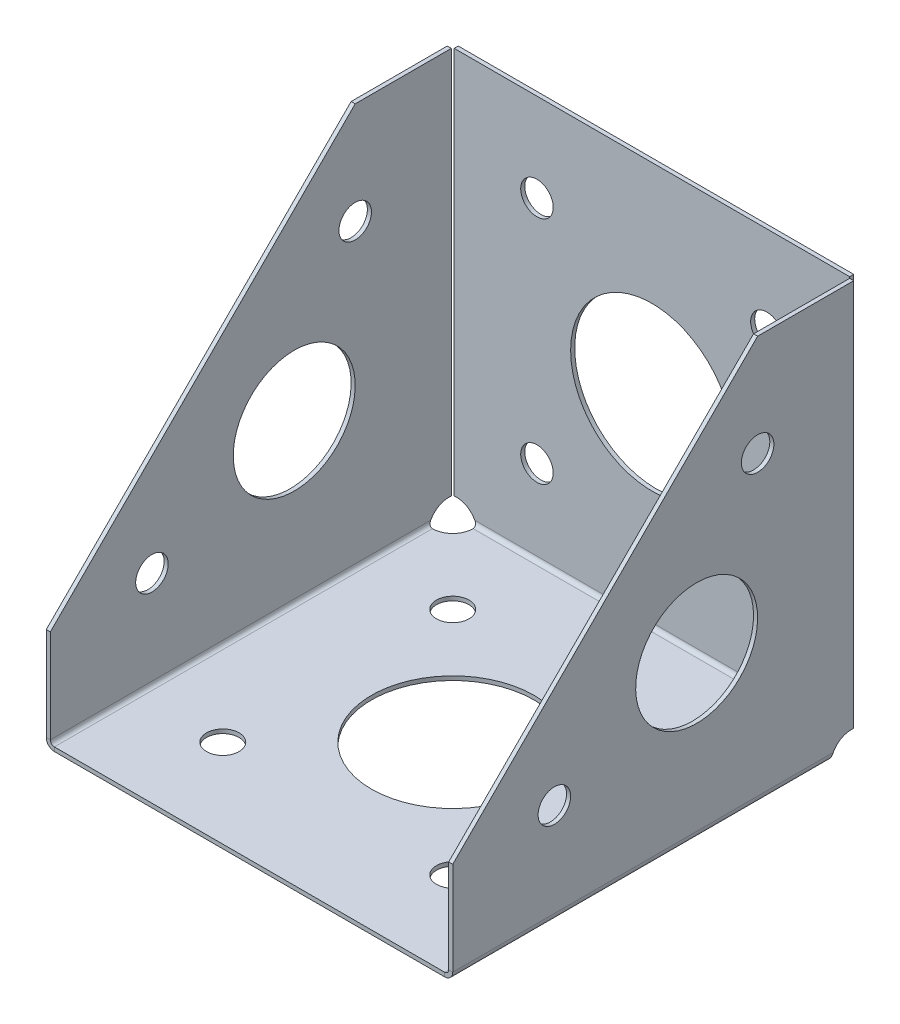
ISO-10303-21;
HEADER;
FILE_DESCRIPTION(('STEP AP214'),'2;1');
FILE_NAME('part.step','',(''),(''),'','','');
FILE_SCHEMA(('AUTOMOTIVE_DESIGN { 1 0 10303 214 1 1 1 1 }'));
ENDSEC;
DATA;
#1=APPLICATION_CONTEXT('core data for automotive mechanical design processes');
#2=APPLICATION_PROTOCOL_DEFINITION('international standard','automotive_design',2000,#1);
#3=PRODUCT_CONTEXT('',#1,'mechanical');
#4=PRODUCT('Part','Part','',(#3));
#5=PRODUCT_RELATED_PRODUCT_CATEGORY('part','',(#4));
#6=PRODUCT_DEFINITION_FORMATION('','',#4);
#7=PRODUCT_DEFINITION_CONTEXT('part definition',#1,'design');
#8=PRODUCT_DEFINITION('design','',#6,#7);
#9=PRODUCT_DEFINITION_SHAPE('','',#8);
#10=(LENGTH_UNIT() NAMED_UNIT(*) SI_UNIT(.MILLI.,.METRE.));
#11=(NAMED_UNIT(*) PLANE_ANGLE_UNIT() SI_UNIT($,.RADIAN.));
#12=(NAMED_UNIT(*) SI_UNIT($,.STERADIAN.) SOLID_ANGLE_UNIT());
#13=UNCERTAINTY_MEASURE_WITH_UNIT(LENGTH_MEASURE(1.E-05),#10,'distance_accuracy_value','');
#14=(GEOMETRIC_REPRESENTATION_CONTEXT(3) GLOBAL_UNCERTAINTY_ASSIGNED_CONTEXT((#13)) GLOBAL_UNIT_ASSIGNED_CONTEXT((#10,
#11,#12)) REPRESENTATION_CONTEXT('',''));
#15=CARTESIAN_POINT('',(0.,0.,0.));
#16=DIRECTION('',(0.,0.,1.));
#17=DIRECTION('',(1.,0.,0.));
#18=AXIS2_PLACEMENT_3D('',#15,#16,#17);
#19=CARTESIAN_POINT('',(0.,-1.,0.));
#20=DIRECTION('',(0.,1.,0.));
#21=DIRECTION('',(0.,0.,1.));
#22=AXIS2_PLACEMENT_3D('',#19,#20,#21);
#23=PLANE('',#22);
#24=CARTESIAN_POINT('',(-28.2842712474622,-1.,-28.2842712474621));
#25=DIRECTION('',(0.,1.,0.));
#26=DIRECTION('',(0.,0.,1.));
#27=AXIS2_PLACEMENT_3D('',#24,#25,#26);
#28=CIRCLE('',#27,3.99999999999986);
#29=CARTESIAN_POINT('',(-28.2842712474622,-1.,-24.2842712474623));
#30=VERTEX_POINT('',#29);
#31=EDGE_CURVE('E814',#30,#30,#28,.T.);
#32=ORIENTED_EDGE('',*,*,#31,.T.);
#33=EDGE_LOOP('',(#32));
#34=FACE_BOUND('',#33,.T.);
#35=CARTESIAN_POINT('',(-28.2842712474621,-1.,28.2842712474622));
#36=DIRECTION('',(0.,1.,0.));
#37=DIRECTION('',(0.,0.,1.));
#38=AXIS2_PLACEMENT_3D('',#35,#36,#37);
#39=CIRCLE('',#38,3.9999999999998);
#40=CARTESIAN_POINT('',(-28.2842712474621,-1.,32.284271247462));
#41=VERTEX_POINT('',#40);
#42=EDGE_CURVE('E821',#41,#41,#39,.T.);
#43=ORIENTED_EDGE('',*,*,#42,.T.);
#44=EDGE_LOOP('',(#43));
#45=FACE_BOUND('',#44,.T.);
#46=CARTESIAN_POINT('',(28.2842712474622,-1.,28.2842712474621));
#47=DIRECTION('',(0.,1.,0.));
#48=DIRECTION('',(0.,0.,1.));
#49=AXIS2_PLACEMENT_3D('',#46,#47,#48);
#50=CIRCLE('',#49,3.99999999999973);
#51=CARTESIAN_POINT('',(28.2842712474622,-1.,32.2842712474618));
#52=VERTEX_POINT('',#51);
#53=EDGE_CURVE('E827',#52,#52,#50,.T.);
#54=ORIENTED_EDGE('',*,*,#53,.T.);
#55=EDGE_LOOP('',(#54));
#56=FACE_BOUND('',#55,.T.);
#57=CARTESIAN_POINT('',(28.2842712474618,-1.,-28.284271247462));
#58=DIRECTION('',(0.,1.,0.));
#59=DIRECTION('',(0.,0.,1.));
#60=AXIS2_PLACEMENT_3D('',#57,#58,#59);
#61=CIRCLE('',#60,4.);
#62=CARTESIAN_POINT('',(28.2842712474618,-1.,-24.284271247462));
#63=VERTEX_POINT('',#62);
#64=EDGE_CURVE('E833',#63,#63,#61,.T.);
#65=ORIENTED_EDGE('',*,*,#64,.T.);
#66=EDGE_LOOP('',(#65));
#67=FACE_BOUND('',#66,.T.);
#68=CARTESIAN_POINT('',(0.,-1.,0.));
#69=DIRECTION('',(0.,1.,0.));
#70=DIRECTION('',(0.,0.,1.));
#71=AXIS2_PLACEMENT_3D('',#68,#69,#70);
#72=CIRCLE('',#71,20.);
#73=CARTESIAN_POINT('',(0.,-1.,20.));
#74=VERTEX_POINT('',#73);
#75=EDGE_CURVE('E839',#74,#74,#72,.T.);
#76=ORIENTED_EDGE('',*,*,#75,.T.);
#77=EDGE_LOOP('',(#76));
#78=FACE_BOUND('',#77,.T.);
#79=CARTESIAN_POINT('',(-48.,-1.,-48.));
#80=DIRECTION('',(0.,1.,0.));
#81=DIRECTION('',(0.,0.,1.));
#82=AXIS2_PLACEMENT_3D('',#79,#80,#81);
#83=CIRCLE('',#82,5.);
#84=CARTESIAN_POINT('',(-48.,-1.00000000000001,-43.));
#85=VERTEX_POINT('',#84);
#86=CARTESIAN_POINT('',(-43.,-1.00000000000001,-48.));
#87=VERTEX_POINT('',#86);
#88=EDGE_CURVE('E968',#85,#87,#83,.T.);
#89=ORIENTED_EDGE('',*,*,#88,.T.);
#90=DIRECTION('',(1.,0.,0.));
#91=VECTOR('',#90,1.);
#92=CARTESIAN_POINT('',(-48.6464466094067,-1.00000000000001,-48.));
#93=LINE('',#92,#91);
#94=CARTESIAN_POINT('',(43.,-1.00000000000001,-48.));
#95=VERTEX_POINT('',#94);
#96=EDGE_CURVE('E844',#87,#95,#93,.T.);
#97=ORIENTED_EDGE('',*,*,#96,.T.);
#98=CARTESIAN_POINT('',(48.,-1.,-48.));
#99=DIRECTION('',(0.,1.,0.));
#100=DIRECTION('',(0.,0.,1.));
#101=AXIS2_PLACEMENT_3D('',#98,#99,#100);
#102=CIRCLE('',#101,5.);
#103=CARTESIAN_POINT('',(48.,-1.00000000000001,-43.));
#104=VERTEX_POINT('',#103);
#105=EDGE_CURVE('E853',#95,#104,#102,.T.);
#106=ORIENTED_EDGE('',*,*,#105,.T.);
#107=DIRECTION('',(0.,0.,1.));
#108=VECTOR('',#107,1.);
#109=CARTESIAN_POINT('',(48.,-1.00000000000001,-48.6464466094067));
#110=LINE('',#109,#108);
#111=CARTESIAN_POINT('',(48.,-1.00000000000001,50.));
#112=VERTEX_POINT('',#111);
#113=EDGE_CURVE('E882',#104,#112,#110,.T.);
#114=ORIENTED_EDGE('',*,*,#113,.T.);
#115=DIRECTION('',(1.,0.,0.));
#116=VECTOR('',#115,1.);
#117=CARTESIAN_POINT('',(-50.,-1.,50.));
#118=LINE('',#117,#116);
#119=CARTESIAN_POINT('',(-48.,-1.00000000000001,50.));
#120=VERTEX_POINT('',#119);
#121=EDGE_CURVE('E842',#120,#112,#118,.T.);
#122=ORIENTED_EDGE('',*,*,#121,.F.);
#123=DIRECTION('',(0.,0.,-1.));
#124=VECTOR('',#123,1.);
#125=CARTESIAN_POINT('',(-48.,-1.00000000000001,50.));
#126=LINE('',#125,#124);
#127=EDGE_CURVE('E971',#120,#85,#126,.T.);
#128=ORIENTED_EDGE('',*,*,#127,.T.);
#129=EDGE_LOOP('',(#89,#97,#106,#114,#122,#128));
#130=FACE_BOUND('',#129,.T.);
#131=ADVANCED_FACE('F147',(#34,#45,#56,#67,#78,#130),#23,.F.);
#132=CARTESIAN_POINT('',(0.,0.,0.));
#133=DIRECTION('',(0.,1.,0.));
#134=DIRECTION('',(0.,0.,1.));
#135=AXIS2_PLACEMENT_3D('',#132,#133,#134);
#136=PLANE('',#135);
#137=CARTESIAN_POINT('',(-28.2842712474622,0.,-28.2842712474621));
#138=DIRECTION('',(0.,1.,0.));
#139=DIRECTION('',(0.,0.,1.));
#140=AXIS2_PLACEMENT_3D('',#137,#138,#139);
#141=CIRCLE('',#140,3.99999999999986);
#142=CARTESIAN_POINT('',(-28.2842712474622,0.,-24.2842712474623));
#143=VERTEX_POINT('',#142);
#144=EDGE_CURVE('E806',#143,#143,#141,.T.);
#145=ORIENTED_EDGE('',*,*,#144,.F.);
#146=EDGE_LOOP('',(#145));
#147=FACE_BOUND('',#146,.T.);
#148=CARTESIAN_POINT('',(-28.2842712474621,0.,28.2842712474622));
#149=DIRECTION('',(0.,1.,0.));
#150=DIRECTION('',(0.,0.,1.));
#151=AXIS2_PLACEMENT_3D('',#148,#149,#150);
#152=CIRCLE('',#151,3.9999999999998);
#153=CARTESIAN_POINT('',(-28.2842712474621,0.,32.284271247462));
#154=VERTEX_POINT('',#153);
#155=EDGE_CURVE('E818',#154,#154,#152,.T.);
#156=ORIENTED_EDGE('',*,*,#155,.F.);
#157=EDGE_LOOP('',(#156));
#158=FACE_BOUND('',#157,.T.);
#159=CARTESIAN_POINT('',(28.2842712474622,0.,28.2842712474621));
#160=DIRECTION('',(0.,1.,0.));
#161=DIRECTION('',(0.,0.,1.));
#162=AXIS2_PLACEMENT_3D('',#159,#160,#161);
#163=CIRCLE('',#162,3.99999999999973);
#164=CARTESIAN_POINT('',(28.2842712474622,0.,32.2842712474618));
#165=VERTEX_POINT('',#164);
#166=EDGE_CURVE('E824',#165,#165,#163,.T.);
#167=ORIENTED_EDGE('',*,*,#166,.F.);
#168=EDGE_LOOP('',(#167));
#169=FACE_BOUND('',#168,.T.);
#170=CARTESIAN_POINT('',(28.2842712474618,0.,-28.284271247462));
#171=DIRECTION('',(0.,1.,0.));
#172=DIRECTION('',(0.,0.,1.));
#173=AXIS2_PLACEMENT_3D('',#170,#171,#172);
#174=CIRCLE('',#173,4.);
#175=CARTESIAN_POINT('',(28.2842712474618,0.,-24.284271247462));
#176=VERTEX_POINT('',#175);
#177=EDGE_CURVE('E830',#176,#176,#174,.T.);
#178=ORIENTED_EDGE('',*,*,#177,.F.);
#179=EDGE_LOOP('',(#178));
#180=FACE_BOUND('',#179,.T.);
#181=CARTESIAN_POINT('',(0.,0.,0.));
#182=DIRECTION('',(0.,1.,0.));
#183=DIRECTION('',(0.,0.,1.));
#184=AXIS2_PLACEMENT_3D('',#181,#182,#183);
#185=CIRCLE('',#184,20.);
#186=CARTESIAN_POINT('',(0.,0.,20.));
#187=VERTEX_POINT('',#186);
#188=EDGE_CURVE('E836',#187,#187,#185,.T.);
#189=ORIENTED_EDGE('',*,*,#188,.F.);
#190=EDGE_LOOP('',(#189));
#191=FACE_BOUND('',#190,.T.);
#192=DIRECTION('',(1.,0.,0.));
#193=VECTOR('',#192,1.);
#194=CARTESIAN_POINT('',(-48.6464466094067,0.,-48.));
#195=LINE('',#194,#193);
#196=CARTESIAN_POINT('',(-43.,0.,-48.));
#197=VERTEX_POINT('',#196);
#198=CARTESIAN_POINT('',(43.,0.,-48.));
#199=VERTEX_POINT('',#198);
#200=EDGE_CURVE('E846',#197,#199,#195,.T.);
#201=ORIENTED_EDGE('',*,*,#200,.F.);
#202=CARTESIAN_POINT('',(-48.,0.,-48.));
#203=DIRECTION('',(0.,1.,0.));
#204=DIRECTION('',(0.,0.,1.));
#205=AXIS2_PLACEMENT_3D('',#202,#203,#204);
#206=CIRCLE('',#205,5.);
#207=CARTESIAN_POINT('',(-48.,0.,-43.));
#208=VERTEX_POINT('',#207);
#209=EDGE_CURVE('E165',#208,#197,#206,.T.);
#210=ORIENTED_EDGE('',*,*,#209,.F.);
#211=DIRECTION('',(0.,0.,-1.));
#212=VECTOR('',#211,1.);
#213=CARTESIAN_POINT('',(-48.,0.,50.));
#214=LINE('',#213,#212);
#215=CARTESIAN_POINT('',(-48.,0.,50.));
#216=VERTEX_POINT('',#215);
#217=EDGE_CURVE('E158',#216,#208,#214,.T.);
#218=ORIENTED_EDGE('',*,*,#217,.F.);
#219=DIRECTION('',(1.,0.,0.));
#220=VECTOR('',#219,1.);
#221=CARTESIAN_POINT('',(-50.,0.,50.));
#222=LINE('',#221,#220);
#223=CARTESIAN_POINT('',(48.,0.,50.));
#224=VERTEX_POINT('',#223);
#225=EDGE_CURVE('E173',#216,#224,#222,.T.);
#226=ORIENTED_EDGE('',*,*,#225,.T.);
#227=DIRECTION('',(0.,0.,1.));
#228=VECTOR('',#227,1.);
#229=CARTESIAN_POINT('',(48.,0.,-48.6464466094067));
#230=LINE('',#229,#228);
#231=CARTESIAN_POINT('',(48.,0.,-43.));
#232=VERTEX_POINT('',#231);
#233=EDGE_CURVE('E1078',#232,#224,#230,.T.);
#234=ORIENTED_EDGE('',*,*,#233,.F.);
#235=CARTESIAN_POINT('',(48.,0.,-48.));
#236=DIRECTION('',(0.,1.,0.));
#237=DIRECTION('',(0.,0.,1.));
#238=AXIS2_PLACEMENT_3D('',#235,#236,#237);
#239=CIRCLE('',#238,5.);
#240=EDGE_CURVE('E815',#199,#232,#239,.T.);
#241=ORIENTED_EDGE('',*,*,#240,.F.);
#242=EDGE_LOOP('',(#201,#210,#218,#226,#234,#241));
#243=FACE_BOUND('',#242,.T.);
#244=ADVANCED_FACE('F929',(#147,#158,#169,#180,#191,#243),#136,.T.);
#245=CARTESIAN_POINT('',(-50.,-1.,50.));
#246=DIRECTION('',(0.,0.,1.));
#247=DIRECTION('',(1.,0.,0.));
#248=AXIS2_PLACEMENT_3D('',#245,#246,#247);
#249=PLANE('',#248);
#250=DIRECTION('',(0.,-1.,0.));
#251=VECTOR('',#250,1.);
#252=CARTESIAN_POINT('',(48.,0.,50.));
#253=LINE('',#252,#251);
#254=EDGE_CURVE('E1070',#224,#112,#253,.T.);
#255=ORIENTED_EDGE('',*,*,#254,.F.);
#256=ORIENTED_EDGE('',*,*,#225,.F.);
#257=DIRECTION('',(0.,-1.,0.));
#258=VECTOR('',#257,1.);
#259=CARTESIAN_POINT('',(-48.,0.,50.));
#260=LINE('',#259,#258);
#261=EDGE_CURVE('E1123',#216,#120,#260,.T.);
#262=ORIENTED_EDGE('',*,*,#261,.T.);
#263=ORIENTED_EDGE('',*,*,#121,.T.);
#264=EDGE_LOOP('',(#255,#256,#262,#263));
#265=FACE_BOUND('',#264,.T.);
#266=ADVANCED_FACE('F149',(#265),#249,.T.);
#267=CARTESIAN_POINT('',(0.,-1.5,0.));
#268=DIRECTION('',(0.,1.,0.));
#269=DIRECTION('',(0.,0.,1.));
#270=AXIS2_PLACEMENT_3D('',#267,#268,#269);
#271=CYLINDRICAL_SURFACE('',#270,20.);
#272=ORIENTED_EDGE('',*,*,#188,.T.);
#273=EDGE_LOOP('',(#272));
#274=FACE_BOUND('',#273,.T.);
#275=ORIENTED_EDGE('',*,*,#75,.F.);
#276=EDGE_LOOP('',(#275));
#277=FACE_BOUND('',#276,.T.);
#278=ADVANCED_FACE('F938',(#274,#277),#271,.F.);
#279=CARTESIAN_POINT('',(28.2842712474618,-1.5,-28.284271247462));
#280=DIRECTION('',(0.,1.,0.));
#281=DIRECTION('',(0.,0.,1.));
#282=AXIS2_PLACEMENT_3D('',#279,#280,#281);
#283=CYLINDRICAL_SURFACE('',#282,4.);
#284=ORIENTED_EDGE('',*,*,#177,.T.);
#285=EDGE_LOOP('',(#284));
#286=FACE_BOUND('',#285,.T.);
#287=ORIENTED_EDGE('',*,*,#64,.F.);
#288=EDGE_LOOP('',(#287));
#289=FACE_BOUND('',#288,.T.);
#290=ADVANCED_FACE('F941',(#286,#289),#283,.F.);
#291=CARTESIAN_POINT('',(28.2842712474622,-1.5,28.2842712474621));
#292=DIRECTION('',(0.,1.,0.));
#293=DIRECTION('',(0.,0.,1.));
#294=AXIS2_PLACEMENT_3D('',#291,#292,#293);
#295=CYLINDRICAL_SURFACE('',#294,3.99999999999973);
#296=ORIENTED_EDGE('',*,*,#166,.T.);
#297=EDGE_LOOP('',(#296));
#298=FACE_BOUND('',#297,.T.);
#299=ORIENTED_EDGE('',*,*,#53,.F.);
#300=EDGE_LOOP('',(#299));
#301=FACE_BOUND('',#300,.T.);
#302=ADVANCED_FACE('F945',(#298,#301),#295,.F.);
#303=CARTESIAN_POINT('',(-28.2842712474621,-1.5,28.2842712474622));
#304=DIRECTION('',(0.,1.,0.));
#305=DIRECTION('',(0.,0.,1.));
#306=AXIS2_PLACEMENT_3D('',#303,#304,#305);
#307=CYLINDRICAL_SURFACE('',#306,3.9999999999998);
#308=ORIENTED_EDGE('',*,*,#155,.T.);
#309=EDGE_LOOP('',(#308));
#310=FACE_BOUND('',#309,.T.);
#311=ORIENTED_EDGE('',*,*,#42,.F.);
#312=EDGE_LOOP('',(#311));
#313=FACE_BOUND('',#312,.T.);
#314=ADVANCED_FACE('F948',(#310,#313),#307,.F.);
#315=CARTESIAN_POINT('',(-28.2842712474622,-1.5,-28.2842712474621));
#316=DIRECTION('',(0.,1.,0.));
#317=DIRECTION('',(0.,0.,1.));
#318=AXIS2_PLACEMENT_3D('',#315,#316,#317);
#319=CYLINDRICAL_SURFACE('',#318,3.99999999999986);
#320=ORIENTED_EDGE('',*,*,#144,.T.);
#321=EDGE_LOOP('',(#320));
#322=FACE_BOUND('',#321,.T.);
#323=ORIENTED_EDGE('',*,*,#31,.F.);
#324=EDGE_LOOP('',(#323));
#325=FACE_BOUND('',#324,.T.);
#326=ADVANCED_FACE('F873',(#322,#325),#319,.F.);
#327=CARTESIAN_POINT('',(48.,-1.,-48.));
#328=DIRECTION('',(0.,1.,0.));
#329=DIRECTION('',(0.,0.,1.));
#330=AXIS2_PLACEMENT_3D('',#327,#328,#329);
#331=CYLINDRICAL_SURFACE('',#330,5.);
#332=CARTESIAN_POINT('',(48.,-1.00000000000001,-43.));
#333=CARTESIAN_POINT('',(48.,0.,-43.));
#334=B_SPLINE_CURVE_WITH_KNOTS('',1,(#332,#333),.UNSPECIFIED.,.F.,.F.,(2,2),(0.,1.),.UNSPECIFIED.);
#335=EDGE_CURVE('E619',#104,#232,#334,.T.);
#336=ORIENTED_EDGE('',*,*,#335,.F.);
#337=ORIENTED_EDGE('',*,*,#105,.F.);
#338=CARTESIAN_POINT('',(43.,0.,-48.));
#339=CARTESIAN_POINT('',(43.,-1.00000000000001,-48.));
#340=B_SPLINE_CURVE_WITH_KNOTS('',1,(#338,#339),.UNSPECIFIED.,.F.,.F.,(2,2),(0.,1.),.UNSPECIFIED.);
#341=EDGE_CURVE('E848',#95,#199,#340,.F.);
#342=ORIENTED_EDGE('',*,*,#341,.T.);
#343=ORIENTED_EDGE('',*,*,#240,.T.);
#344=EDGE_LOOP('',(#336,#337,#342,#343));
#345=FACE_BOUND('',#344,.T.);
#346=ADVANCED_FACE('F864',(#345),#331,.F.);
#347=CARTESIAN_POINT('',(-48.,0.,-48.));
#348=DIRECTION('',(0.,1.,0.));
#349=DIRECTION('',(0.,0.,1.));
#350=AXIS2_PLACEMENT_3D('',#347,#348,#349);
#351=CYLINDRICAL_SURFACE('',#350,5.);
#352=ORIENTED_EDGE('',*,*,#209,.T.);
#353=CARTESIAN_POINT('',(-43.,-1.00000000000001,-48.));
#354=CARTESIAN_POINT('',(-43.,0.,-48.));
#355=B_SPLINE_CURVE_WITH_KNOTS('',1,(#353,#354),.UNSPECIFIED.,.F.,.F.,(2,2),(0.,1.),.UNSPECIFIED.);
#356=EDGE_CURVE('E849',#197,#87,#355,.F.);
#357=ORIENTED_EDGE('',*,*,#356,.T.);
#358=ORIENTED_EDGE('',*,*,#88,.F.);
#359=CARTESIAN_POINT('',(-48.,0.,-43.));
#360=CARTESIAN_POINT('',(-48.,-1.00000000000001,-43.));
#361=B_SPLINE_CURVE_WITH_KNOTS('',1,(#359,#360),.UNSPECIFIED.,.F.,.F.,(2,2),(0.,1.),.UNSPECIFIED.);
#362=EDGE_CURVE('E13',#208,#85,#361,.T.);
#363=ORIENTED_EDGE('',*,*,#362,.F.);
#364=EDGE_LOOP('',(#352,#357,#358,#363));
#365=FACE_BOUND('',#364,.T.);
#366=ADVANCED_FACE('F776',(#365),#351,.F.);
#367=CARTESIAN_POINT('',(-43.,-1.00000000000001,-48.));
#368=CARTESIAN_POINT('',(-43.0105270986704,-1.00000000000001,-48.198306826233));
#369=CARTESIAN_POINT('',(-43.0215432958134,-0.97064241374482,-48.3802594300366));
#370=CARTESIAN_POINT('',(-43.0446218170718,-0.879998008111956,-48.7025925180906));
#371=CARTESIAN_POINT('',(-43.0566728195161,-0.818827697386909,-48.8429497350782));
#372=CARTESIAN_POINT('',(-43.094361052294,-0.62134362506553,-49.2025134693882));
#373=CARTESIAN_POINT('',(-43.1217015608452,-0.473434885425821,-49.3606851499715));
#374=CARTESIAN_POINT('',(-43.1652786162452,-0.308950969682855,-49.5140231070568));
#375=CARTESIAN_POINT('',(-43.1853232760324,-0.242081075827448,-49.5707437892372));
#376=CARTESIAN_POINT('',(-43.2364505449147,-0.0791912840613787,-49.6868158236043));
#377=CARTESIAN_POINT('',(-43.2675331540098,0.0169011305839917,-49.746183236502));
#378=CARTESIAN_POINT('',(-43.3773379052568,0.354670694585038,-49.9094782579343));
#379=CARTESIAN_POINT('',(-43.4720737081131,0.648064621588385,-50.));
#380=CARTESIAN_POINT('',(-43.5899719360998,0.999999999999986,-50.));
#381=CARTESIAN_POINT('',(-43.,0.,-48.));
#382=CARTESIAN_POINT('',(-43.0105270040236,0.,-48.0991525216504));
#383=CARTESIAN_POINT('',(-43.0215432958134,0.0146787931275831,-48.1901297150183));
#384=CARTESIAN_POINT('',(-43.0446218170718,0.0600009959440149,-48.3512962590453));
#385=CARTESIAN_POINT('',(-43.0566728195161,0.090586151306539,-48.4214748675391));
#386=CARTESIAN_POINT('',(-43.094361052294,0.189328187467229,-48.6012567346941));
#387=CARTESIAN_POINT('',(-43.1217015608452,0.263282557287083,-48.6803425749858));
#388=CARTESIAN_POINT('',(-43.1652786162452,0.345524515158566,-48.7570115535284));
#389=CARTESIAN_POINT('',(-43.1853232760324,0.378959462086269,-48.7853718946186));
#390=CARTESIAN_POINT('',(-43.2364505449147,0.460404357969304,-48.8434079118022));
#391=CARTESIAN_POINT('',(-43.2675331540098,0.508450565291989,-48.873091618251));
#392=CARTESIAN_POINT('',(-43.3773379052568,0.677335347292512,-48.9547391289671));
#393=CARTESIAN_POINT('',(-43.4721999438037,0.824220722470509,-49.));
#394=CARTESIAN_POINT('',(-43.5899719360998,0.999999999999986,-49.));
#395=B_SPLINE_SURFACE_WITH_KNOTS('',1,3,((#367,#368,#369,#370,#371,#372,#373,#374,#375,#376,
#377,#378,#379,#380),(#381,#382,#383,#384,#385,#386,#387,#388,#389,#390,#391,#392,#393,#394)),
.UNSPECIFIED.,.F.,.F.,.F.,(2,2),(4,2,2,2,2,2,4),(0.,1.),(0.,0.125,0.25,0.5,0.625,0.75,1.),.UNSPECIFIED.);
#396=CARTESIAN_POINT('',(-43.,0.,-48.));
#397=CARTESIAN_POINT('',(-43.0105270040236,0.,-48.0991525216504));
#398=CARTESIAN_POINT('',(-43.0215432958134,0.0146787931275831,-48.1901297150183));
#399=CARTESIAN_POINT('',(-43.0446218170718,0.0600009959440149,-48.3512962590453));
#400=CARTESIAN_POINT('',(-43.0566728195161,0.090586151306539,-48.4214748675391));
#401=CARTESIAN_POINT('',(-43.094361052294,0.189328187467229,-48.6012567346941));
#402=CARTESIAN_POINT('',(-43.1217015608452,0.263282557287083,-48.6803425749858));
#403=CARTESIAN_POINT('',(-43.1652786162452,0.345524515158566,-48.7570115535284));
#404=CARTESIAN_POINT('',(-43.1853232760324,0.378959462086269,-48.7853718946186));
#405=CARTESIAN_POINT('',(-43.2364505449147,0.460404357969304,-48.8434079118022));
#406=CARTESIAN_POINT('',(-43.2675331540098,0.508450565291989,-48.873091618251));
#407=CARTESIAN_POINT('',(-43.3773379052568,0.677335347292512,-48.9547391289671));
#408=CARTESIAN_POINT('',(-43.4721999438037,0.824220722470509,-49.));
#409=CARTESIAN_POINT('',(-43.5899719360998,0.999999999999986,-49.));
#410=B_SPLINE_CURVE_WITH_KNOTS('',3,(#396,#397,#398,#399,#400,#401,#402,#403,#404,#405,#406,
#407,#408,#409),.UNSPECIFIED.,.F.,.F.,(4,2,2,2,2,2,4),(0.,0.125,0.25,0.5,0.625,0.75,1.),.UNSPECIFIED.);
#411=CARTESIAN_POINT('',(-43.5899719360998,0.999999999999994,-49.));
#412=VERTEX_POINT('',#411);
#413=EDGE_CURVE('E1063',#197,#412,#410,.T.);
#414=CARTESIAN_POINT('',(-43.5899719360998,0.999999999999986,-49.));
#415=CARTESIAN_POINT('',(-43.5899719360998,0.999999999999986,-50.));
#416=B_SPLINE_CURVE_WITH_KNOTS('',1,(#414,#415),.UNSPECIFIED.,.F.,.F.,(2,2),(0.,1.),.UNSPECIFIED.);
#417=CARTESIAN_POINT('',(-43.5899719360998,0.999999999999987,-50.));
#418=VERTEX_POINT('',#417);
#419=EDGE_CURVE('E996',#418,#412,#416,.F.);
#420=CARTESIAN_POINT('',(-43.5899719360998,0.999999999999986,-50.));
#421=CARTESIAN_POINT('',(-43.4720737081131,0.648064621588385,-50.));
#422=CARTESIAN_POINT('',(-43.3773379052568,0.354670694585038,-49.9094782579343));
#423=CARTESIAN_POINT('',(-43.2675331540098,0.0169011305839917,-49.746183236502));
#424=CARTESIAN_POINT('',(-43.2364505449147,-0.0791912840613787,-49.6868158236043));
#425=CARTESIAN_POINT('',(-43.1853232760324,-0.242081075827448,-49.5707437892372));
#426=CARTESIAN_POINT('',(-43.1652786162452,-0.308950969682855,-49.5140231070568));
#427=CARTESIAN_POINT('',(-43.1217015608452,-0.473434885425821,-49.3606851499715));
#428=CARTESIAN_POINT('',(-43.094361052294,-0.62134362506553,-49.2025134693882));
#429=CARTESIAN_POINT('',(-43.0566728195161,-0.818827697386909,-48.8429497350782));
#430=CARTESIAN_POINT('',(-43.0446218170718,-0.879998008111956,-48.7025925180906));
#431=CARTESIAN_POINT('',(-43.0215432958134,-0.97064241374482,-48.3802594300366));
#432=CARTESIAN_POINT('',(-43.0105270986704,-1.00000000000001,-48.198306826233));
#433=CARTESIAN_POINT('',(-43.,-1.00000000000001,-48.));
#434=B_SPLINE_CURVE_WITH_KNOTS('',3,(#420,#421,#422,#423,#424,#425,#426,#427,#428,#429,#430,
#431,#432,#433),.UNSPECIFIED.,.F.,.F.,(4,2,2,2,2,2,4),(0.,0.25,0.375,0.5,0.75,0.875,1.),.UNSPECIFIED.);
#435=EDGE_CURVE('E1097',#87,#418,#434,.F.);
#436=ORIENTED_EDGE('',*,*,#356,.F.);
#437=ORIENTED_EDGE('',*,*,#413,.T.);
#438=ORIENTED_EDGE('',*,*,#419,.F.);
#439=ORIENTED_EDGE('',*,*,#435,.F.);
#440=EDGE_LOOP('',(#436,#437,#438,#439));
#441=FACE_BOUND('',#440,.T.);
#442=ADVANCED_FACE('F772',(#441),#395,.T.);
#443=CARTESIAN_POINT('',(43.5899719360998,0.999999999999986,-50.));
#444=CARTESIAN_POINT('',(43.4720737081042,0.648064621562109,-50.));
#445=CARTESIAN_POINT('',(43.3773379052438,0.35467069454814,-49.9094782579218));
#446=CARTESIAN_POINT('',(43.2675331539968,0.0169011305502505,-49.7461832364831));
#447=CARTESIAN_POINT('',(43.2364505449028,-0.0791912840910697,-49.6868158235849));
#448=CARTESIAN_POINT('',(43.1853232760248,-0.242081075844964,-49.570743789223));
#449=CARTESIAN_POINT('',(43.1653626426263,-0.308633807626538,-49.5143187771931));
#450=CARTESIAN_POINT('',(43.1361432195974,-0.418924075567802,-49.411502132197));
#451=CARTESIAN_POINT('',(43.1220452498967,-0.482594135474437,-49.346538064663));
#452=CARTESIAN_POINT('',(43.0948727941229,-0.616700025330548,-49.1821722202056));
#453=CARTESIAN_POINT('',(43.0817983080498,-0.687171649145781,-49.0826588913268));
#454=CARTESIAN_POINT('',(43.0566728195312,-0.818827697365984,-48.8429497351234));
#455=CARTESIAN_POINT('',(43.0446218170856,-0.879998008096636,-48.7025925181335));
#456=CARTESIAN_POINT('',(43.0215432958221,-0.970642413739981,-48.3802594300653));
#457=CARTESIAN_POINT('',(43.0105270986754,-1.00000000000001,-48.1983068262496));
#458=CARTESIAN_POINT('',(43.,-1.00000000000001,-48.));
#459=CARTESIAN_POINT('',(43.5899719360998,0.999999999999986,-49.));
#460=CARTESIAN_POINT('',(43.4721999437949,0.824220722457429,-49.));
#461=CARTESIAN_POINT('',(43.3773379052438,0.677335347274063,-48.9547391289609));
#462=CARTESIAN_POINT('',(43.2675331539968,0.508450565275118,-48.8730916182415));
#463=CARTESIAN_POINT('',(43.2364505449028,0.460404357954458,-48.8434079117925));
#464=CARTESIAN_POINT('',(43.1853232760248,0.378959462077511,-48.7853718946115));
#465=CARTESIAN_POINT('',(43.1653626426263,0.345683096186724,-48.7571593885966));
#466=CARTESIAN_POINT('',(43.1361432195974,0.290537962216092,-48.7057510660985));
#467=CARTESIAN_POINT('',(43.1220452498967,0.258702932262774,-48.6732690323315));
#468=CARTESIAN_POINT('',(43.0948727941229,0.191649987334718,-48.5910861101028));
#469=CARTESIAN_POINT('',(43.0817983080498,0.156414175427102,-48.5413294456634));
#470=CARTESIAN_POINT('',(43.0566728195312,0.0905861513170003,-48.4214748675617));
#471=CARTESIAN_POINT('',(43.0446218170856,0.0600009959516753,-48.3512962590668));
#472=CARTESIAN_POINT('',(43.0215432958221,0.014678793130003,-48.1901297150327));
#473=CARTESIAN_POINT('',(43.0105270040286,0.,-48.0991525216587));
#474=CARTESIAN_POINT('',(43.,0.,-48.));
#475=B_SPLINE_SURFACE_WITH_KNOTS('',1,3,((#443,#444,#445,#446,#447,#448,#449,#450,#451,#452,
#453,#454,#455,#456,#457,#458),(#459,#460,#461,#462,#463,#464,#465,#466,#467,#468,#469,#470,
#471,#472,#473,#474)),.UNSPECIFIED.,.F.,.F.,.F.,(2,2),(4,2,2,2,2,2,2,4),(0.,1.),(0.,0.25,0.375,
0.5,0.625,0.75,0.875,1.),.UNSPECIFIED.);
#476=CARTESIAN_POINT('',(43.5899719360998,0.999999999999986,-49.));
#477=CARTESIAN_POINT('',(43.4721999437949,0.824220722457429,-49.));
#478=CARTESIAN_POINT('',(43.3773379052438,0.677335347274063,-48.9547391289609));
#479=CARTESIAN_POINT('',(43.2675331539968,0.508450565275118,-48.8730916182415));
#480=CARTESIAN_POINT('',(43.2364505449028,0.460404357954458,-48.8434079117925));
#481=CARTESIAN_POINT('',(43.1853232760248,0.378959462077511,-48.7853718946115));
#482=CARTESIAN_POINT('',(43.1653626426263,0.345683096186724,-48.7571593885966));
#483=CARTESIAN_POINT('',(43.1361432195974,0.290537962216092,-48.7057510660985));
#484=CARTESIAN_POINT('',(43.1220452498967,0.258702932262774,-48.6732690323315));
#485=CARTESIAN_POINT('',(43.0948727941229,0.191649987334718,-48.5910861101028));
#486=CARTESIAN_POINT('',(43.0817983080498,0.156414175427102,-48.5413294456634));
#487=CARTESIAN_POINT('',(43.0566728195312,0.0905861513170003,-48.4214748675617));
#488=CARTESIAN_POINT('',(43.0446218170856,0.0600009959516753,-48.3512962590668));
#489=CARTESIAN_POINT('',(43.0215432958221,0.014678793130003,-48.1901297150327));
#490=CARTESIAN_POINT('',(43.0105270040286,0.,-48.0991525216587));
#491=CARTESIAN_POINT('',(43.,0.,-48.));
#492=B_SPLINE_CURVE_WITH_KNOTS('',3,(#476,#477,#478,#479,#480,#481,#482,#483,#484,#485,#486,
#487,#488,#489,#490,#491),.UNSPECIFIED.,.F.,.F.,(4,2,2,2,2,2,2,4),(0.,0.25,0.375,0.5,0.625,0.75,
0.875,1.),.UNSPECIFIED.);
#493=CARTESIAN_POINT('',(43.5899719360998,0.999999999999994,-49.));
#494=VERTEX_POINT('',#493);
#495=EDGE_CURVE('E745',#494,#199,#492,.T.);
#496=CARTESIAN_POINT('',(43.,-1.00000000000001,-48.));
#497=CARTESIAN_POINT('',(43.0105270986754,-1.00000000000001,-48.1983068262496));
#498=CARTESIAN_POINT('',(43.0215432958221,-0.970642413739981,-48.3802594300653));
#499=CARTESIAN_POINT('',(43.0446218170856,-0.879998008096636,-48.7025925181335));
#500=CARTESIAN_POINT('',(43.0566728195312,-0.818827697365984,-48.8429497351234));
#501=CARTESIAN_POINT('',(43.0817983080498,-0.687171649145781,-49.0826588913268));
#502=CARTESIAN_POINT('',(43.0948727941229,-0.616700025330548,-49.1821722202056));
#503=CARTESIAN_POINT('',(43.1220452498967,-0.482594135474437,-49.346538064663));
#504=CARTESIAN_POINT('',(43.1361432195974,-0.418924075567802,-49.411502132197));
#505=CARTESIAN_POINT('',(43.1653626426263,-0.308633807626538,-49.5143187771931));
#506=CARTESIAN_POINT('',(43.1853232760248,-0.242081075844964,-49.570743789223));
#507=CARTESIAN_POINT('',(43.2364505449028,-0.0791912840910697,-49.6868158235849));
#508=CARTESIAN_POINT('',(43.2675331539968,0.0169011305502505,-49.7461832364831));
#509=CARTESIAN_POINT('',(43.3773379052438,0.35467069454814,-49.9094782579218));
#510=CARTESIAN_POINT('',(43.4720737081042,0.648064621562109,-50.));
#511=CARTESIAN_POINT('',(43.5899719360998,0.999999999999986,-50.));
#512=B_SPLINE_CURVE_WITH_KNOTS('',3,(#496,#497,#498,#499,#500,#501,#502,#503,#504,#505,#506,
#507,#508,#509,#510,#511),.UNSPECIFIED.,.F.,.F.,(4,2,2,2,2,2,2,4),(0.,0.125,0.25,0.375,0.5,
0.625,0.75,1.),.UNSPECIFIED.);
#513=CARTESIAN_POINT('',(43.5899719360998,1.00000000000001,-50.));
#514=VERTEX_POINT('',#513);
#515=EDGE_CURVE('E738',#514,#95,#512,.F.);
#516=CARTESIAN_POINT('',(43.5899719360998,0.999999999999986,-50.));
#517=CARTESIAN_POINT('',(43.5899719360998,0.999999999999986,-49.));
#518=B_SPLINE_CURVE_WITH_KNOTS('',1,(#516,#517),.UNSPECIFIED.,.F.,.F.,(2,2),(0.,1.),.UNSPECIFIED.);
#519=EDGE_CURVE('E802',#514,#494,#518,.T.);
#520=ORIENTED_EDGE('',*,*,#495,.T.);
#521=ORIENTED_EDGE('',*,*,#341,.F.);
#522=ORIENTED_EDGE('',*,*,#515,.F.);
#523=ORIENTED_EDGE('',*,*,#519,.T.);
#524=EDGE_LOOP('',(#520,#521,#522,#523));
#525=FACE_BOUND('',#524,.T.);
#526=ADVANCED_FACE('F713',(#525),#475,.T.);
#527=CARTESIAN_POINT('',(-87.2175112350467,0.999999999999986,-48.));
#528=DIRECTION('',(1.,0.,0.));
#529=DIRECTION('',(0.,0.,-1.));
#530=AXIS2_PLACEMENT_3D('',#527,#528,#529);
#531=CYLINDRICAL_SURFACE('',#530,2.);
#532=DIRECTION('',(1.,0.,0.));
#533=VECTOR('',#532,1.);
#534=CARTESIAN_POINT('',(50.,0.999999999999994,-50.));
#535=LINE('',#534,#533);
#536=EDGE_CURVE('E538',#418,#514,#535,.T.);
#537=ORIENTED_EDGE('',*,*,#536,.T.);
#538=ORIENTED_EDGE('',*,*,#515,.T.);
#539=ORIENTED_EDGE('',*,*,#96,.F.);
#540=ORIENTED_EDGE('',*,*,#435,.T.);
#541=EDGE_LOOP('',(#537,#538,#539,#540));
#542=FACE_BOUND('',#541,.T.);
#543=ADVANCED_FACE('F702',(#542),#531,.T.);
#544=CARTESIAN_POINT('',(-87.2175112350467,0.999999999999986,-48.));
#545=DIRECTION('',(1.,0.,0.));
#546=DIRECTION('',(0.,0.,-1.));
#547=AXIS2_PLACEMENT_3D('',#544,#545,#546);
#548=CYLINDRICAL_SURFACE('',#547,1.);
#549=DIRECTION('',(-1.,0.,0.));
#550=VECTOR('',#549,1.);
#551=CARTESIAN_POINT('',(50.,0.99999999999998,-49.));
#552=LINE('',#551,#550);
#553=EDGE_CURVE('E693',#494,#412,#552,.T.);
#554=ORIENTED_EDGE('',*,*,#553,.T.);
#555=ORIENTED_EDGE('',*,*,#413,.F.);
#556=ORIENTED_EDGE('',*,*,#200,.T.);
#557=ORIENTED_EDGE('',*,*,#495,.F.);
#558=EDGE_LOOP('',(#554,#555,#556,#557));
#559=FACE_BOUND('',#558,.T.);
#560=ADVANCED_FACE('F712',(#559),#548,.F.);
#561=CARTESIAN_POINT('',(48.6464466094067,0.,-49.));
#562=DIRECTION('',(1.,0.,0.));
#563=DIRECTION('',(0.,0.,-1.));
#564=AXIS2_PLACEMENT_3D('',#561,#562,#563);
#565=PLANE('',#564);
#566=DIRECTION('',(0.,1.,0.));
#567=VECTOR('',#566,1.);
#568=CARTESIAN_POINT('',(48.6464466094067,-1.87350135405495E-13,-49.));
#569=LINE('',#568,#567);
#570=CARTESIAN_POINT('',(48.6464466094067,3.60184007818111,-49.));
#571=VERTEX_POINT('',#570);
#572=CARTESIAN_POINT('',(48.6464466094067,99.,-49.0000000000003));
#573=VERTEX_POINT('',#572);
#574=EDGE_CURVE('E631',#571,#573,#569,.T.);
#575=ORIENTED_EDGE('',*,*,#574,.F.);
#576=DIRECTION('',(0.,0.,-1.));
#577=VECTOR('',#576,1.);
#578=CARTESIAN_POINT('',(48.6464466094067,3.60184007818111,-50.));
#579=LINE('',#578,#577);
#580=CARTESIAN_POINT('',(48.6464466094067,3.60184007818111,-50.));
#581=VERTEX_POINT('',#580);
#582=EDGE_CURVE('E623',#581,#571,#579,.F.);
#583=ORIENTED_EDGE('',*,*,#582,.F.);
#584=DIRECTION('',(0.,-1.,0.));
#585=VECTOR('',#584,1.);
#586=CARTESIAN_POINT('',(48.6464466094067,0.,-50.));
#587=LINE('',#586,#585);
#588=CARTESIAN_POINT('',(48.6464466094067,99.,-50.0000000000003));
#589=VERTEX_POINT('',#588);
#590=EDGE_CURVE('E691',#581,#589,#587,.F.);
#591=ORIENTED_EDGE('',*,*,#590,.T.);
#592=DIRECTION('',(0.,0.,-1.));
#593=VECTOR('',#592,1.);
#594=CARTESIAN_POINT('',(48.6464466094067,99.,-49.0000000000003));
#595=LINE('',#594,#593);
#596=EDGE_CURVE('E688',#589,#573,#595,.F.);
#597=ORIENTED_EDGE('',*,*,#596,.T.);
#598=EDGE_LOOP('',(#575,#583,#591,#597));
#599=FACE_BOUND('',#598,.T.);
#600=ADVANCED_FACE('F1498',(#599),#565,.T.);
#601=CARTESIAN_POINT('',(50.,99.,-50.0000000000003));
#602=DIRECTION('',(0.,-1.,0.));
#603=DIRECTION('',(0.,0.,-1.));
#604=AXIS2_PLACEMENT_3D('',#601,#602,#603);
#605=PLANE('',#604);
#606=DIRECTION('',(1.,0.,0.));
#607=VECTOR('',#606,1.);
#608=CARTESIAN_POINT('',(0.,99.,-50.0000000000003));
#609=LINE('',#608,#607);
#610=CARTESIAN_POINT('',(-48.6464466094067,99.,-50.0000000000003));
#611=VERTEX_POINT('',#610);
#612=EDGE_CURVE('E636',#611,#589,#609,.T.);
#613=ORIENTED_EDGE('',*,*,#612,.F.);
#614=DIRECTION('',(0.,0.,1.));
#615=VECTOR('',#614,1.);
#616=CARTESIAN_POINT('',(-48.6464466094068,99.,-50.0000000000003));
#617=LINE('',#616,#615);
#618=CARTESIAN_POINT('',(-48.6464466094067,99.,-49.0000000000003));
#619=VERTEX_POINT('',#618);
#620=EDGE_CURVE('E685',#611,#619,#617,.T.);
#621=ORIENTED_EDGE('',*,*,#620,.T.);
#622=DIRECTION('',(-1.,0.,0.));
#623=VECTOR('',#622,1.);
#624=CARTESIAN_POINT('',(50.,99.,-49.0000000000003));
#625=LINE('',#624,#623);
#626=EDGE_CURVE('E682',#619,#573,#625,.F.);
#627=ORIENTED_EDGE('',*,*,#626,.T.);
#628=ORIENTED_EDGE('',*,*,#596,.F.);
#629=EDGE_LOOP('',(#613,#621,#627,#628));
#630=FACE_BOUND('',#629,.T.);
#631=ADVANCED_FACE('F1052',(#630),#605,.F.);
#632=CARTESIAN_POINT('',(-48.6464466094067,0.,-49.));
#633=DIRECTION('',(1.,0.,0.));
#634=DIRECTION('',(0.,0.,-1.));
#635=AXIS2_PLACEMENT_3D('',#632,#633,#634);
#636=PLANE('',#635);
#637=DIRECTION('',(0.,0.,-1.));
#638=VECTOR('',#637,1.);
#639=CARTESIAN_POINT('',(-48.6464466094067,3.60184007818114,-50.));
#640=LINE('',#639,#638);
#641=CARTESIAN_POINT('',(-48.6464466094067,3.60184007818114,-50.));
#642=VERTEX_POINT('',#641);
#643=CARTESIAN_POINT('',(-48.6464466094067,3.60184007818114,-49.));
#644=VERTEX_POINT('',#643);
#645=EDGE_CURVE('E677',#642,#644,#640,.F.);
#646=ORIENTED_EDGE('',*,*,#645,.T.);
#647=DIRECTION('',(0.,-1.,0.));
#648=VECTOR('',#647,1.);
#649=CARTESIAN_POINT('',(-48.6464466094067,0.,-49.));
#650=LINE('',#649,#648);
#651=EDGE_CURVE('E675',#644,#619,#650,.F.);
#652=ORIENTED_EDGE('',*,*,#651,.T.);
#653=ORIENTED_EDGE('',*,*,#620,.F.);
#654=DIRECTION('',(0.,1.,0.));
#655=VECTOR('',#654,1.);
#656=CARTESIAN_POINT('',(-48.6464466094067,-1.87350135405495E-13,-50.));
#657=LINE('',#656,#655);
#658=EDGE_CURVE('E640',#642,#611,#657,.T.);
#659=ORIENTED_EDGE('',*,*,#658,.F.);
#660=EDGE_LOOP('',(#646,#652,#653,#659));
#661=FACE_BOUND('',#660,.T.);
#662=ADVANCED_FACE('F1048',(#661),#636,.F.);
#663=CARTESIAN_POINT('',(0.,49.,-50.5));
#664=DIRECTION('',(0.,0.,1.));
#665=DIRECTION('',(1.,0.,0.));
#666=AXIS2_PLACEMENT_3D('',#663,#664,#665);
#667=CYLINDRICAL_SURFACE('',#666,20.);
#668=CARTESIAN_POINT('',(0.,49.,-49.));
#669=DIRECTION('',(0.,0.,1.));
#670=DIRECTION('',(1.,0.,0.));
#671=AXIS2_PLACEMENT_3D('',#668,#669,#670);
#672=CIRCLE('',#671,20.);
#673=CARTESIAN_POINT('',(20.,49.,-49.));
#674=VERTEX_POINT('',#673);
#675=EDGE_CURVE('E672',#674,#674,#672,.T.);
#676=ORIENTED_EDGE('',*,*,#675,.T.);
#677=EDGE_LOOP('',(#676));
#678=FACE_BOUND('',#677,.T.);
#679=CARTESIAN_POINT('',(0.,49.,-50.0000000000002));
#680=DIRECTION('',(0.,0.,1.));
#681=DIRECTION('',(0.,-1.,0.));
#682=AXIS2_PLACEMENT_3D('',#679,#680,#681);
#683=CIRCLE('',#682,20.);
#684=CARTESIAN_POINT('',(0.,29.,-50.0000000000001));
#685=VERTEX_POINT('',#684);
#686=EDGE_CURVE('E645',#685,#685,#683,.T.);
#687=ORIENTED_EDGE('',*,*,#686,.F.);
#688=EDGE_LOOP('',(#687));
#689=FACE_BOUND('',#688,.T.);
#690=ADVANCED_FACE('F1525',(#678,#689),#667,.F.);
#691=CARTESIAN_POINT('',(28.2842712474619,77.2842712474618,-50.5));
#692=DIRECTION('',(0.,0.,1.));
#693=DIRECTION('',(1.,0.,0.));
#694=AXIS2_PLACEMENT_3D('',#691,#692,#693);
#695=CYLINDRICAL_SURFACE('',#694,4.00000000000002);
#696=CARTESIAN_POINT('',(28.2842712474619,77.2842712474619,-49.));
#697=DIRECTION('',(0.,0.,1.));
#698=DIRECTION('',(1.,0.,0.));
#699=AXIS2_PLACEMENT_3D('',#696,#697,#698);
#700=CIRCLE('',#699,4.00000000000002);
#701=CARTESIAN_POINT('',(32.284271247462,77.2842712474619,-49.));
#702=VERTEX_POINT('',#701);
#703=EDGE_CURVE('E669',#702,#702,#700,.T.);
#704=ORIENTED_EDGE('',*,*,#703,.T.);
#705=EDGE_LOOP('',(#704));
#706=FACE_BOUND('',#705,.T.);
#707=CARTESIAN_POINT('',(28.2842712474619,77.2842712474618,-50.0000000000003));
#708=DIRECTION('',(0.,0.,1.));
#709=DIRECTION('',(0.,-1.,0.));
#710=AXIS2_PLACEMENT_3D('',#707,#708,#709);
#711=CIRCLE('',#710,4.00000000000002);
#712=CARTESIAN_POINT('',(28.2842712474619,73.2842712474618,-50.0000000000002));
#713=VERTEX_POINT('',#712);
#714=EDGE_CURVE('E648',#713,#713,#711,.T.);
#715=ORIENTED_EDGE('',*,*,#714,.F.);
#716=EDGE_LOOP('',(#715));
#717=FACE_BOUND('',#716,.T.);
#718=ADVANCED_FACE('F1534',(#706,#717),#695,.F.);
#719=CARTESIAN_POINT('',(28.2842712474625,20.7157287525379,-50.5));
#720=DIRECTION('',(0.,0.,1.));
#721=DIRECTION('',(1.,0.,0.));
#722=AXIS2_PLACEMENT_3D('',#719,#720,#721);
#723=CYLINDRICAL_SURFACE('',#722,4.);
#724=CARTESIAN_POINT('',(28.2842712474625,20.7157287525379,-49.));
#725=DIRECTION('',(0.,0.,1.));
#726=DIRECTION('',(1.,0.,0.));
#727=AXIS2_PLACEMENT_3D('',#724,#725,#726);
#728=CIRCLE('',#727,4.);
#729=CARTESIAN_POINT('',(32.2842712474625,20.7157287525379,-49.));
#730=VERTEX_POINT('',#729);
#731=EDGE_CURVE('E666',#730,#730,#728,.T.);
#732=ORIENTED_EDGE('',*,*,#731,.T.);
#733=EDGE_LOOP('',(#732));
#734=FACE_BOUND('',#733,.T.);
#735=CARTESIAN_POINT('',(28.2842712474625,20.7157287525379,-50.0000000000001));
#736=DIRECTION('',(0.,0.,1.));
#737=DIRECTION('',(0.,-1.,0.));
#738=AXIS2_PLACEMENT_3D('',#735,#736,#737);
#739=CIRCLE('',#738,4.);
#740=CARTESIAN_POINT('',(28.2842712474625,16.7157287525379,-50.));
#741=VERTEX_POINT('',#740);
#742=EDGE_CURVE('E651',#741,#741,#739,.T.);
#743=ORIENTED_EDGE('',*,*,#742,.F.);
#744=EDGE_LOOP('',(#743));
#745=FACE_BOUND('',#744,.T.);
#746=ADVANCED_FACE('F1545',(#734,#745),#723,.F.);
#747=CARTESIAN_POINT('',(-28.2842712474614,20.7157287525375,-50.5));
#748=DIRECTION('',(0.,0.,1.));
#749=DIRECTION('',(1.,0.,0.));
#750=AXIS2_PLACEMENT_3D('',#747,#748,#749);
#751=CYLINDRICAL_SURFACE('',#750,4.00000000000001);
#752=CARTESIAN_POINT('',(-28.2842712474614,20.7157287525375,-49.));
#753=DIRECTION('',(0.,0.,1.));
#754=DIRECTION('',(1.,0.,0.));
#755=AXIS2_PLACEMENT_3D('',#752,#753,#754);
#756=CIRCLE('',#755,4.00000000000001);
#757=CARTESIAN_POINT('',(-24.2842712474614,20.7157287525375,-49.));
#758=VERTEX_POINT('',#757);
#759=EDGE_CURVE('E663',#758,#758,#756,.T.);
#760=ORIENTED_EDGE('',*,*,#759,.T.);
#761=EDGE_LOOP('',(#760));
#762=FACE_BOUND('',#761,.T.);
#763=CARTESIAN_POINT('',(-28.2842712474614,20.7157287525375,-50.0000000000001));
#764=DIRECTION('',(0.,0.,1.));
#765=DIRECTION('',(0.,-1.,0.));
#766=AXIS2_PLACEMENT_3D('',#763,#764,#765);
#767=CIRCLE('',#766,4.00000000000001);
#768=CARTESIAN_POINT('',(-28.2842712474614,16.7157287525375,-50.));
#769=VERTEX_POINT('',#768);
#770=EDGE_CURVE('E654',#769,#769,#767,.T.);
#771=ORIENTED_EDGE('',*,*,#770,.F.);
#772=EDGE_LOOP('',(#771));
#773=FACE_BOUND('',#772,.T.);
#774=ADVANCED_FACE('F1556',(#762,#773),#751,.F.);
#775=CARTESIAN_POINT('',(-28.2842712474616,77.2842712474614,-50.5));
#776=DIRECTION('',(0.,0.,1.));
#777=DIRECTION('',(1.,0.,0.));
#778=AXIS2_PLACEMENT_3D('',#775,#776,#777);
#779=CYLINDRICAL_SURFACE('',#778,3.99999999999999);
#780=CARTESIAN_POINT('',(-28.2842712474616,77.2842712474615,-49.));
#781=DIRECTION('',(0.,0.,1.));
#782=DIRECTION('',(1.,0.,0.));
#783=AXIS2_PLACEMENT_3D('',#780,#781,#782);
#784=CIRCLE('',#783,3.99999999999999);
#785=CARTESIAN_POINT('',(-24.2842712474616,77.2842712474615,-49.));
#786=VERTEX_POINT('',#785);
#787=EDGE_CURVE('E660',#786,#786,#784,.T.);
#788=ORIENTED_EDGE('',*,*,#787,.T.);
#789=EDGE_LOOP('',(#788));
#790=FACE_BOUND('',#789,.T.);
#791=CARTESIAN_POINT('',(-28.2842712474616,77.2842712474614,-50.0000000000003));
#792=DIRECTION('',(0.,0.,1.));
#793=DIRECTION('',(0.,-1.,0.));
#794=AXIS2_PLACEMENT_3D('',#791,#792,#793);
#795=CIRCLE('',#794,3.99999999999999);
#796=CARTESIAN_POINT('',(-28.2842712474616,73.2842712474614,-50.0000000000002));
#797=VERTEX_POINT('',#796);
#798=EDGE_CURVE('E657',#797,#797,#795,.T.);
#799=ORIENTED_EDGE('',*,*,#798,.F.);
#800=EDGE_LOOP('',(#799));
#801=FACE_BOUND('',#800,.T.);
#802=ADVANCED_FACE('F1567',(#790,#801),#779,.F.);
#803=CARTESIAN_POINT('',(0.,-1.87350135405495E-13,-50.));
#804=DIRECTION('',(0.,0.,1.));
#805=DIRECTION('',(0.,-1.,0.));
#806=AXIS2_PLACEMENT_3D('',#803,#804,#805);
#807=PLANE('',#806);
#808=ORIENTED_EDGE('',*,*,#798,.T.);
#809=EDGE_LOOP('',(#808));
#810=FACE_BOUND('',#809,.T.);
#811=ORIENTED_EDGE('',*,*,#770,.T.);
#812=EDGE_LOOP('',(#811));
#813=FACE_BOUND('',#812,.T.);
#814=ORIENTED_EDGE('',*,*,#742,.T.);
#815=EDGE_LOOP('',(#814));
#816=FACE_BOUND('',#815,.T.);
#817=ORIENTED_EDGE('',*,*,#714,.T.);
#818=EDGE_LOOP('',(#817));
#819=FACE_BOUND('',#818,.T.);
#820=ORIENTED_EDGE('',*,*,#686,.T.);
#821=EDGE_LOOP('',(#820));
#822=FACE_BOUND('',#821,.T.);
#823=CARTESIAN_POINT('',(-48.,-1.35619449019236,-50.));
#824=DIRECTION('',(0.,0.,1.));
#825=DIRECTION('',(0.,-1.,0.));
#826=AXIS2_PLACEMENT_3D('',#823,#824,#825);
#827=CIRCLE('',#826,5.);
#828=EDGE_CURVE('E642',#418,#642,#827,.T.);
#829=ORIENTED_EDGE('',*,*,#828,.T.);
#830=ORIENTED_EDGE('',*,*,#658,.T.);
#831=ORIENTED_EDGE('',*,*,#612,.T.);
#832=ORIENTED_EDGE('',*,*,#590,.F.);
#833=CARTESIAN_POINT('',(48.,-1.35619449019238,-50.));
#834=DIRECTION('',(0.,0.,1.));
#835=DIRECTION('',(0.,-1.,0.));
#836=AXIS2_PLACEMENT_3D('',#833,#834,#835);
#837=CIRCLE('',#836,5.);
#838=EDGE_CURVE('E639',#581,#514,#837,.T.);
#839=ORIENTED_EDGE('',*,*,#838,.T.);
#840=ORIENTED_EDGE('',*,*,#536,.F.);
#841=EDGE_LOOP('',(#829,#830,#831,#832,#839,#840));
#842=FACE_BOUND('',#841,.T.);
#843=ADVANCED_FACE('F1025',(#810,#813,#816,#819,#822,#842),#807,.F.);
#844=CARTESIAN_POINT('',(-48.,-1.35619449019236,-50.));
#845=DIRECTION('',(0.,0.,1.));
#846=DIRECTION('',(0.,-1.,0.));
#847=AXIS2_PLACEMENT_3D('',#844,#845,#846);
#848=CYLINDRICAL_SURFACE('',#847,5.);
#849=ORIENTED_EDGE('',*,*,#645,.F.);
#850=ORIENTED_EDGE('',*,*,#828,.F.);
#851=ORIENTED_EDGE('',*,*,#419,.T.);
#852=CARTESIAN_POINT('',(-48.,-1.35619449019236,-49.));
#853=DIRECTION('',(0.,0.,1.));
#854=DIRECTION('',(0.,-1.,0.));
#855=AXIS2_PLACEMENT_3D('',#852,#853,#854);
#856=CIRCLE('',#855,5.);
#857=EDGE_CURVE('E633',#412,#644,#856,.T.);
#858=ORIENTED_EDGE('',*,*,#857,.T.);
#859=EDGE_LOOP('',(#849,#850,#851,#858));
#860=FACE_BOUND('',#859,.T.);
#861=ADVANCED_FACE('F1015',(#860),#848,.F.);
#862=CARTESIAN_POINT('',(0.,-1.87350135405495E-13,-49.));
#863=DIRECTION('',(0.,0.,1.));
#864=DIRECTION('',(0.,-1.,0.));
#865=AXIS2_PLACEMENT_3D('',#862,#863,#864);
#866=PLANE('',#865);
#867=ORIENTED_EDGE('',*,*,#787,.F.);
#868=EDGE_LOOP('',(#867));
#869=FACE_BOUND('',#868,.T.);
#870=ORIENTED_EDGE('',*,*,#759,.F.);
#871=EDGE_LOOP('',(#870));
#872=FACE_BOUND('',#871,.T.);
#873=ORIENTED_EDGE('',*,*,#731,.F.);
#874=EDGE_LOOP('',(#873));
#875=FACE_BOUND('',#874,.T.);
#876=ORIENTED_EDGE('',*,*,#703,.F.);
#877=EDGE_LOOP('',(#876));
#878=FACE_BOUND('',#877,.T.);
#879=ORIENTED_EDGE('',*,*,#675,.F.);
#880=EDGE_LOOP('',(#879));
#881=FACE_BOUND('',#880,.T.);
#882=ORIENTED_EDGE('',*,*,#651,.F.);
#883=ORIENTED_EDGE('',*,*,#857,.F.);
#884=ORIENTED_EDGE('',*,*,#553,.F.);
#885=CARTESIAN_POINT('',(48.,-1.35619449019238,-49.));
#886=DIRECTION('',(0.,0.,1.));
#887=DIRECTION('',(0.,-1.,0.));
#888=AXIS2_PLACEMENT_3D('',#885,#886,#887);
#889=CIRCLE('',#888,5.);
#890=EDGE_CURVE('E630',#571,#494,#889,.T.);
#891=ORIENTED_EDGE('',*,*,#890,.F.);
#892=ORIENTED_EDGE('',*,*,#574,.T.);
#893=ORIENTED_EDGE('',*,*,#626,.F.);
#894=EDGE_LOOP('',(#882,#883,#884,#891,#892,#893));
#895=FACE_BOUND('',#894,.T.);
#896=ADVANCED_FACE('F1024',(#869,#872,#875,#878,#881,#895),#866,.T.);
#897=CARTESIAN_POINT('',(48.,-1.35619449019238,-50.));
#898=DIRECTION('',(0.,0.,1.));
#899=DIRECTION('',(0.,-1.,0.));
#900=AXIS2_PLACEMENT_3D('',#897,#898,#899);
#901=CYLINDRICAL_SURFACE('',#900,5.);
#902=ORIENTED_EDGE('',*,*,#519,.F.);
#903=ORIENTED_EDGE('',*,*,#838,.F.);
#904=ORIENTED_EDGE('',*,*,#582,.T.);
#905=ORIENTED_EDGE('',*,*,#890,.T.);
#906=EDGE_LOOP('',(#902,#903,#904,#905));
#907=FACE_BOUND('',#906,.T.);
#908=ADVANCED_FACE('F715',(#907),#901,.F.);
#909=CARTESIAN_POINT('',(48.,-1.00000000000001,-43.));
#910=CARTESIAN_POINT('',(48.191872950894,-1.00000000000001,-43.0069189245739));
#911=CARTESIAN_POINT('',(48.361681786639,-0.972725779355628,-43.0142920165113));
#912=CARTESIAN_POINT('',(48.6516422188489,-0.896792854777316,-43.0299997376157));
#913=CARTESIAN_POINT('',(48.7718565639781,-0.848222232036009,-43.0383254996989));
#914=CARTESIAN_POINT('',(48.9179065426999,-0.777742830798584,-43.0515219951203));
#915=CARTESIAN_POINT('',(48.9609324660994,-0.754568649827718,-43.0560388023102));
#916=CARTESIAN_POINT('',(49.0176153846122,-0.721898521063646,-43.0629909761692));
#917=CARTESIAN_POINT('',(49.0346785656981,-0.71168538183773,-43.0652568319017));
#918=CARTESIAN_POINT('',(49.0698069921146,-0.689952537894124,-43.0703846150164));
#919=CARTESIAN_POINT('',(49.0876739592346,-0.678522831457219,-43.073221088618));
#920=CARTESIAN_POINT('',(49.178334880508,-0.618364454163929,-43.0887663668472));
#921=CARTESIAN_POINT('',(49.2552007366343,-0.560591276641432,-43.1055639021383));
#922=CARTESIAN_POINT('',(49.4894513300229,-0.351085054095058,-43.1690404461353));
#923=CARTESIAN_POINT('',(49.6518853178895,-0.161843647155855,-43.2288033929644));
#924=CARTESIAN_POINT('',(49.9076776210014,0.337148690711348,-43.3832197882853));
#925=CARTESIAN_POINT('',(50.,0.647425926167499,-43.4774412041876));
#926=CARTESIAN_POINT('',(50.,0.999999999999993,-43.5899719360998));
#927=CARTESIAN_POINT('',(48.,0.,-43.));
#928=CARTESIAN_POINT('',(48.0959359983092,0.,-43.0069188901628));
#929=CARTESIAN_POINT('',(48.1808408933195,0.0136371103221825,-43.0142920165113));
#930=CARTESIAN_POINT('',(48.3258211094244,0.0516035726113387,-43.0299997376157));
#931=CARTESIAN_POINT('',(48.385928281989,0.0758888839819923,-43.0383254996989));
#932=CARTESIAN_POINT('',(48.45895327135,0.111128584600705,-43.0515219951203));
#933=CARTESIAN_POINT('',(48.4804662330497,0.122715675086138,-43.0560388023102));
#934=CARTESIAN_POINT('',(48.5088076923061,0.139050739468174,-43.0629909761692));
#935=CARTESIAN_POINT('',(48.5173392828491,0.144157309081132,-43.0652568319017));
#936=CARTESIAN_POINT('',(48.5349034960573,0.155023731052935,-43.0703846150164));
#937=CARTESIAN_POINT('',(48.5438369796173,0.160738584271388,-43.073221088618));
#938=CARTESIAN_POINT('',(48.589167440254,0.190817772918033,-43.0887663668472));
#939=CARTESIAN_POINT('',(48.6276003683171,0.219704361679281,-43.1055639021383));
#940=CARTESIAN_POINT('',(48.7447256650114,0.324457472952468,-43.1690404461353));
#941=CARTESIAN_POINT('',(48.8259426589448,0.41907817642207,-43.2288033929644));
#942=CARTESIAN_POINT('',(48.9538388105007,0.668574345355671,-43.3832197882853));
#943=CARTESIAN_POINT('',(49.,0.823859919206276,-43.4775350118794));
#944=CARTESIAN_POINT('',(49.,0.999999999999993,-43.5899719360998));
#945=B_SPLINE_SURFACE_WITH_KNOTS('',1,3,((#909,#910,#911,#912,#913,#914,#915,#916,#917,#918,
#919,#920,#921,#922,#923,#924,#925,#926),(#927,#928,#929,#930,#931,#932,#933,#934,#935,#936,
#937,#938,#939,#940,#941,#942,#943,#944)),.UNSPECIFIED.,.F.,.F.,.F.,(2,2),(4,2,2,2,2,2,2,2,4),
(0.,1.),(0.,0.125,0.25,0.3125,0.34375,0.375,0.5,0.75,1.),.UNSPECIFIED.);
#946=CARTESIAN_POINT('',(48.,0.,-43.));
#947=CARTESIAN_POINT('',(48.0959359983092,0.,-43.0069188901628));
#948=CARTESIAN_POINT('',(48.1808408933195,0.0136371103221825,-43.0142920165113));
#949=CARTESIAN_POINT('',(48.3258211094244,0.0516035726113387,-43.0299997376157));
#950=CARTESIAN_POINT('',(48.385928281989,0.0758888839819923,-43.0383254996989));
#951=CARTESIAN_POINT('',(48.45895327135,0.111128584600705,-43.0515219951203));
#952=CARTESIAN_POINT('',(48.4804662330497,0.122715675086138,-43.0560388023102));
#953=CARTESIAN_POINT('',(48.5088076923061,0.139050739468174,-43.0629909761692));
#954=CARTESIAN_POINT('',(48.5173392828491,0.144157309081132,-43.0652568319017));
#955=CARTESIAN_POINT('',(48.5349034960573,0.155023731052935,-43.0703846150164));
#956=CARTESIAN_POINT('',(48.5438369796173,0.160738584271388,-43.073221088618));
#957=CARTESIAN_POINT('',(48.589167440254,0.190817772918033,-43.0887663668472));
#958=CARTESIAN_POINT('',(48.6276003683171,0.219704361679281,-43.1055639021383));
#959=CARTESIAN_POINT('',(48.7447256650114,0.324457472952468,-43.1690404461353));
#960=CARTESIAN_POINT('',(48.8259426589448,0.41907817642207,-43.2288033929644));
#961=CARTESIAN_POINT('',(48.9538388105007,0.668574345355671,-43.3832197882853));
#962=CARTESIAN_POINT('',(49.,0.823859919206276,-43.4775350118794));
#963=CARTESIAN_POINT('',(49.,0.999999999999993,-43.5899719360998));
#964=B_SPLINE_CURVE_WITH_KNOTS('',3,(#946,#947,#948,#949,#950,#951,#952,#953,#954,#955,#956,
#957,#958,#959,#960,#961,#962,#963),.UNSPECIFIED.,.F.,.F.,(4,2,2,2,2,2,2,2,4),(0.,0.125,0.25,
0.3125,0.34375,0.375,0.5,0.75,1.),.UNSPECIFIED.);
#965=CARTESIAN_POINT('',(49.,1.00000000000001,-43.5899719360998));
#966=VERTEX_POINT('',#965);
#967=EDGE_CURVE('E477',#232,#966,#964,.T.);
#968=CARTESIAN_POINT('',(49.,0.999999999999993,-43.5899719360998));
#969=CARTESIAN_POINT('',(50.,0.999999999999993,-43.5899719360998));
#970=B_SPLINE_CURVE_WITH_KNOTS('',1,(#968,#969),.UNSPECIFIED.,.F.,.F.,(2,2),(0.,1.),.UNSPECIFIED.);
#971=CARTESIAN_POINT('',(50.,1.00000000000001,-43.5899719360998));
#972=VERTEX_POINT('',#971);
#973=EDGE_CURVE('E487',#972,#966,#970,.F.);
#974=CARTESIAN_POINT('',(50.,0.999999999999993,-43.5899719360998));
#975=CARTESIAN_POINT('',(50.,0.647425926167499,-43.4774412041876));
#976=CARTESIAN_POINT('',(49.9076776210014,0.337148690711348,-43.3832197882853));
#977=CARTESIAN_POINT('',(49.6518853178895,-0.161843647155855,-43.2288033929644));
#978=CARTESIAN_POINT('',(49.4894513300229,-0.351085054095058,-43.1690404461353));
#979=CARTESIAN_POINT('',(49.2552007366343,-0.560591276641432,-43.1055639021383));
#980=CARTESIAN_POINT('',(49.178334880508,-0.618364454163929,-43.0887663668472));
#981=CARTESIAN_POINT('',(49.0876739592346,-0.678522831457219,-43.073221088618));
#982=CARTESIAN_POINT('',(49.0698069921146,-0.689952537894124,-43.0703846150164));
#983=CARTESIAN_POINT('',(49.0346785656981,-0.71168538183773,-43.0652568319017));
#984=CARTESIAN_POINT('',(49.0176153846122,-0.721898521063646,-43.0629909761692));
#985=CARTESIAN_POINT('',(48.9609324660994,-0.754568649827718,-43.0560388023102));
#986=CARTESIAN_POINT('',(48.9179065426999,-0.777742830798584,-43.0515219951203));
#987=CARTESIAN_POINT('',(48.7718565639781,-0.848222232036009,-43.0383254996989));
#988=CARTESIAN_POINT('',(48.6516422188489,-0.896792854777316,-43.0299997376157));
#989=CARTESIAN_POINT('',(48.361681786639,-0.972725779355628,-43.0142920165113));
#990=CARTESIAN_POINT('',(48.191872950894,-1.00000000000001,-43.0069189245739));
#991=CARTESIAN_POINT('',(48.,-1.00000000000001,-43.));
#992=B_SPLINE_CURVE_WITH_KNOTS('',3,(#974,#975,#976,#977,#978,#979,#980,#981,#982,#983,#984,
#985,#986,#987,#988,#989,#990,#991),.UNSPECIFIED.,.F.,.F.,(4,2,2,2,2,2,2,2,4),(0.,0.25,0.5,
0.625,0.65625,0.6875,0.75,0.875,1.),.UNSPECIFIED.);
#993=EDGE_CURVE('E539',#104,#972,#992,.F.);
#994=ORIENTED_EDGE('',*,*,#335,.T.);
#995=ORIENTED_EDGE('',*,*,#967,.T.);
#996=ORIENTED_EDGE('',*,*,#973,.F.);
#997=ORIENTED_EDGE('',*,*,#993,.F.);
#998=EDGE_LOOP('',(#994,#995,#996,#997));
#999=FACE_BOUND('',#998,.T.);
#1000=ADVANCED_FACE('F569',(#999),#945,.T.);
#1001=CARTESIAN_POINT('',(48.,0.999999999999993,50.));
#1002=DIRECTION('',(0.,0.,1.));
#1003=DIRECTION('',(1.,0.,0.));
#1004=AXIS2_PLACEMENT_3D('',#1001,#1002,#1003);
#1005=PLANE('',#1004);
#1006=CARTESIAN_POINT('',(48.,0.999999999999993,50.));
#1007=DIRECTION('',(0.,0.,1.));
#1008=DIRECTION('',(1.,0.,0.));
#1009=AXIS2_PLACEMENT_3D('',#1006,#1007,#1008);
#1010=CIRCLE('',#1009,1.);
#1011=CARTESIAN_POINT('',(49.,1.00000000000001,50.));
#1012=VERTEX_POINT('',#1011);
#1013=EDGE_CURVE('E540',#1012,#224,#1010,.F.);
#1014=ORIENTED_EDGE('',*,*,#1013,.T.);
#1015=ORIENTED_EDGE('',*,*,#254,.T.);
#1016=CARTESIAN_POINT('',(48.,0.999999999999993,50.));
#1017=DIRECTION('',(0.,0.,-1.));
#1018=DIRECTION('',(-1.,0.,0.));
#1019=AXIS2_PLACEMENT_3D('',#1016,#1017,#1018);
#1020=CIRCLE('',#1019,2.);
#1021=CARTESIAN_POINT('',(50.,0.999999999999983,50.));
#1022=VERTEX_POINT('',#1021);
#1023=EDGE_CURVE('E535',#1022,#112,#1020,.T.);
#1024=ORIENTED_EDGE('',*,*,#1023,.F.);
#1025=DIRECTION('',(1.,0.,0.));
#1026=VECTOR('',#1025,1.);
#1027=CARTESIAN_POINT('',(50.,1.00000000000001,50.));
#1028=LINE('',#1027,#1026);
#1029=EDGE_CURVE('E470',#1012,#1022,#1028,.T.);
#1030=ORIENTED_EDGE('',*,*,#1029,.F.);
#1031=EDGE_LOOP('',(#1014,#1015,#1024,#1030));
#1032=FACE_BOUND('',#1031,.T.);
#1033=ADVANCED_FACE('F560',(#1032),#1005,.T.);
#1034=CARTESIAN_POINT('',(48.,0.999999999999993,-90.1249672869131));
#1035=DIRECTION('',(0.,0.,1.));
#1036=DIRECTION('',(1.,0.,0.));
#1037=AXIS2_PLACEMENT_3D('',#1034,#1035,#1036);
#1038=CYLINDRICAL_SURFACE('',#1037,2.);
#1039=DIRECTION('',(0.,0.,1.));
#1040=VECTOR('',#1039,1.);
#1041=CARTESIAN_POINT('',(50.,1.00000000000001,50.));
#1042=LINE('',#1041,#1040);
#1043=EDGE_CURVE('E391',#972,#1022,#1042,.T.);
#1044=ORIENTED_EDGE('',*,*,#1043,.T.);
#1045=ORIENTED_EDGE('',*,*,#1023,.T.);
#1046=ORIENTED_EDGE('',*,*,#113,.F.);
#1047=ORIENTED_EDGE('',*,*,#993,.T.);
#1048=EDGE_LOOP('',(#1044,#1045,#1046,#1047));
#1049=FACE_BOUND('',#1048,.T.);
#1050=ADVANCED_FACE('F549',(#1049),#1038,.T.);
#1051=CARTESIAN_POINT('',(48.,0.999999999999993,-90.1249672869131));
#1052=DIRECTION('',(0.,0.,1.));
#1053=DIRECTION('',(1.,0.,0.));
#1054=AXIS2_PLACEMENT_3D('',#1051,#1052,#1053);
#1055=CYLINDRICAL_SURFACE('',#1054,1.);
#1056=DIRECTION('',(0.,0.,-1.));
#1057=VECTOR('',#1056,1.);
#1058=CARTESIAN_POINT('',(49.,1.00000000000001,50.));
#1059=LINE('',#1058,#1057);
#1060=EDGE_CURVE('E534',#1012,#966,#1059,.T.);
#1061=ORIENTED_EDGE('',*,*,#1060,.T.);
#1062=ORIENTED_EDGE('',*,*,#967,.F.);
#1063=ORIENTED_EDGE('',*,*,#233,.T.);
#1064=ORIENTED_EDGE('',*,*,#1013,.F.);
#1065=EDGE_LOOP('',(#1061,#1062,#1063,#1064));
#1066=FACE_BOUND('',#1065,.T.);
#1067=ADVANCED_FACE('F559',(#1066),#1055,.F.);
#1068=CARTESIAN_POINT('',(50.0000000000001,37.,37.));
#1069=DIRECTION('',(0.,-0.707106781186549,-0.707106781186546));
#1070=DIRECTION('',(0.,-0.707106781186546,0.707106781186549));
#1071=AXIS2_PLACEMENT_3D('',#1068,#1069,#1070);
#1072=PLANE('',#1071);
#1073=DIRECTION('',(1.,0.,0.));
#1074=VECTOR('',#1073,1.);
#1075=CARTESIAN_POINT('',(50.0000000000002,24.,50.));
#1076=LINE('',#1075,#1074);
#1077=CARTESIAN_POINT('',(50.0000000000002,24.,50.));
#1078=VERTEX_POINT('',#1077);
#1079=CARTESIAN_POINT('',(49.0000000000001,24.,50.));
#1080=VERTEX_POINT('',#1079);
#1081=EDGE_CURVE('E480',#1078,#1080,#1076,.F.);
#1082=ORIENTED_EDGE('',*,*,#1081,.F.);
#1083=DIRECTION('',(0.,-0.707106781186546,0.707106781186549));
#1084=VECTOR('',#1083,1.);
#1085=CARTESIAN_POINT('',(50.0000000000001,37.,37.));
#1086=LINE('',#1085,#1084);
#1087=CARTESIAN_POINT('',(50.0000000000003,99.,-25.0000000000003));
#1088=VERTEX_POINT('',#1087);
#1089=EDGE_CURVE('E488',#1088,#1078,#1086,.T.);
#1090=ORIENTED_EDGE('',*,*,#1089,.F.);
#1091=DIRECTION('',(1.,0.,0.));
#1092=VECTOR('',#1091,1.);
#1093=CARTESIAN_POINT('',(50.0000000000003,99.,-25.0000000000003));
#1094=LINE('',#1093,#1092);
#1095=CARTESIAN_POINT('',(49.0000000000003,99.,-25.0000000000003));
#1096=VERTEX_POINT('',#1095);
#1097=EDGE_CURVE('E532',#1088,#1096,#1094,.F.);
#1098=ORIENTED_EDGE('',*,*,#1097,.T.);
#1099=DIRECTION('',(0.,-0.707106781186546,0.707106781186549));
#1100=VECTOR('',#1099,1.);
#1101=CARTESIAN_POINT('',(49.0000000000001,37.,37.));
#1102=LINE('',#1101,#1100);
#1103=EDGE_CURVE('E530',#1096,#1080,#1102,.T.);
#1104=ORIENTED_EDGE('',*,*,#1103,.T.);
#1105=EDGE_LOOP('',(#1082,#1090,#1098,#1104));
#1106=FACE_BOUND('',#1105,.T.);
#1107=ADVANCED_FACE('F567',(#1106),#1072,.F.);
#1108=CARTESIAN_POINT('',(50.0000000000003,99.,50.));
#1109=DIRECTION('',(0.,-1.,0.));
#1110=DIRECTION('',(1.,0.,0.));
#1111=AXIS2_PLACEMENT_3D('',#1108,#1109,#1110);
#1112=PLANE('',#1111);
#1113=ORIENTED_EDGE('',*,*,#1097,.F.);
#1114=DIRECTION('',(0.,0.,1.));
#1115=VECTOR('',#1114,1.);
#1116=CARTESIAN_POINT('',(50.0000000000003,99.,0.));
#1117=LINE('',#1116,#1115);
#1118=CARTESIAN_POINT('',(50.0000000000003,99.,-48.6464466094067));
#1119=VERTEX_POINT('',#1118);
#1120=EDGE_CURVE('E491',#1119,#1088,#1117,.T.);
#1121=ORIENTED_EDGE('',*,*,#1120,.F.);
#1122=DIRECTION('',(-1.,0.,0.));
#1123=VECTOR('',#1122,1.);
#1124=CARTESIAN_POINT('',(50.0000000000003,99.,-48.6464466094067));
#1125=LINE('',#1124,#1123);
#1126=CARTESIAN_POINT('',(49.0000000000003,99.,-48.6464466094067));
#1127=VERTEX_POINT('',#1126);
#1128=EDGE_CURVE('E527',#1119,#1127,#1125,.T.);
#1129=ORIENTED_EDGE('',*,*,#1128,.T.);
#1130=DIRECTION('',(0.,0.,-1.));
#1131=VECTOR('',#1130,1.);
#1132=CARTESIAN_POINT('',(49.0000000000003,99.,50.));
#1133=LINE('',#1132,#1131);
#1134=EDGE_CURVE('E524',#1127,#1096,#1133,.F.);
#1135=ORIENTED_EDGE('',*,*,#1134,.T.);
#1136=EDGE_LOOP('',(#1113,#1121,#1129,#1135));
#1137=FACE_BOUND('',#1136,.T.);
#1138=ADVANCED_FACE('F1150',(#1137),#1112,.F.);
#1139=CARTESIAN_POINT('',(49.,0.,-48.6464466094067));
#1140=DIRECTION('',(0.,0.,1.));
#1141=DIRECTION('',(0.,-1.,0.));
#1142=AXIS2_PLACEMENT_3D('',#1139,#1140,#1141);
#1143=PLANE('',#1142);
#1144=DIRECTION('',(1.,0.,0.));
#1145=VECTOR('',#1144,1.);
#1146=CARTESIAN_POINT('',(50.,3.60184007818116,-48.6464466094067));
#1147=LINE('',#1146,#1145);
#1148=CARTESIAN_POINT('',(50.,3.60184007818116,-48.6464466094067));
#1149=VERTEX_POINT('',#1148);
#1150=CARTESIAN_POINT('',(49.,3.60184007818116,-48.6464466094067));
#1151=VERTEX_POINT('',#1150);
#1152=EDGE_CURVE('E519',#1149,#1151,#1147,.F.);
#1153=ORIENTED_EDGE('',*,*,#1152,.T.);
#1154=DIRECTION('',(0.,-1.,0.));
#1155=VECTOR('',#1154,1.);
#1156=CARTESIAN_POINT('',(49.,0.,-48.6464466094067));
#1157=LINE('',#1156,#1155);
#1158=EDGE_CURVE('E517',#1151,#1127,#1157,.F.);
#1159=ORIENTED_EDGE('',*,*,#1158,.T.);
#1160=ORIENTED_EDGE('',*,*,#1128,.F.);
#1161=DIRECTION('',(0.,1.,0.));
#1162=VECTOR('',#1161,1.);
#1163=CARTESIAN_POINT('',(50.,-1.52655665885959E-13,-48.6464466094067));
#1164=LINE('',#1163,#1162);
#1165=EDGE_CURVE('E494',#1149,#1119,#1164,.T.);
#1166=ORIENTED_EDGE('',*,*,#1165,.F.);
#1167=EDGE_LOOP('',(#1153,#1159,#1160,#1166));
#1168=FACE_BOUND('',#1167,.T.);
#1169=ADVANCED_FACE('F1144',(#1168),#1143,.F.);
#1170=CARTESIAN_POINT('',(-50.0000000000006,39.0000000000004,-9.99999999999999));
#1171=DIRECTION('',(1.,0.,0.));
#1172=DIRECTION('',(0.,1.,0.));
#1173=AXIS2_PLACEMENT_3D('',#1170,#1171,#1172);
#1174=CYLINDRICAL_SURFACE('',#1173,15.);
#1175=CARTESIAN_POINT('',(49.0000000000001,39.,-10.));
#1176=DIRECTION('',(-1.,0.,0.));
#1177=DIRECTION('',(0.,-1.,0.));
#1178=AXIS2_PLACEMENT_3D('',#1175,#1176,#1177);
#1179=CIRCLE('',#1178,15.);
#1180=CARTESIAN_POINT('',(49.0000000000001,24.,-10.));
#1181=VERTEX_POINT('',#1180);
#1182=EDGE_CURVE('E514',#1181,#1181,#1179,.T.);
#1183=ORIENTED_EDGE('',*,*,#1182,.T.);
#1184=EDGE_LOOP('',(#1183));
#1185=FACE_BOUND('',#1184,.T.);
#1186=CARTESIAN_POINT('',(50.0000000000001,39.,-10.));
#1187=DIRECTION('',(1.,0.,0.));
#1188=DIRECTION('',(0.,1.,0.));
#1189=AXIS2_PLACEMENT_3D('',#1186,#1187,#1188);
#1190=CIRCLE('',#1189,15.);
#1191=CARTESIAN_POINT('',(50.0000000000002,54.,-10.));
#1192=VERTEX_POINT('',#1191);
#1193=EDGE_CURVE('E511',#1192,#1192,#1190,.T.);
#1194=ORIENTED_EDGE('',*,*,#1193,.T.);
#1195=EDGE_LOOP('',(#1194));
#1196=FACE_BOUND('',#1195,.T.);
#1197=ADVANCED_FACE('F1162',(#1185,#1196),#1174,.F.);
#1198=CARTESIAN_POINT('',(-50.0000000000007,24.0000000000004,25.));
#1199=DIRECTION('',(1.,0.,0.));
#1200=DIRECTION('',(0.,1.,0.));
#1201=AXIS2_PLACEMENT_3D('',#1198,#1199,#1200);
#1202=CYLINDRICAL_SURFACE('',#1201,4.);
#1203=CARTESIAN_POINT('',(49.0000000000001,24.,25.));
#1204=DIRECTION('',(-1.,0.,0.));
#1205=DIRECTION('',(0.,-1.,0.));
#1206=AXIS2_PLACEMENT_3D('',#1203,#1204,#1205);
#1207=CIRCLE('',#1206,4.);
#1208=CARTESIAN_POINT('',(49.,20.,25.));
#1209=VERTEX_POINT('',#1208);
#1210=EDGE_CURVE('E508',#1209,#1209,#1207,.T.);
#1211=ORIENTED_EDGE('',*,*,#1210,.T.);
#1212=EDGE_LOOP('',(#1211));
#1213=FACE_BOUND('',#1212,.T.);
#1214=CARTESIAN_POINT('',(50.0000000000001,24.,25.));
#1215=DIRECTION('',(1.,0.,0.));
#1216=DIRECTION('',(0.,1.,0.));
#1217=AXIS2_PLACEMENT_3D('',#1214,#1215,#1216);
#1218=CIRCLE('',#1217,4.);
#1219=CARTESIAN_POINT('',(50.0000000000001,28.,25.));
#1220=VERTEX_POINT('',#1219);
#1221=EDGE_CURVE('E505',#1220,#1220,#1218,.T.);
#1222=ORIENTED_EDGE('',*,*,#1221,.T.);
#1223=EDGE_LOOP('',(#1222));
#1224=FACE_BOUND('',#1223,.T.);
#1225=ADVANCED_FACE('F1165',(#1213,#1224),#1202,.F.);
#1226=CARTESIAN_POINT('',(-50.0000000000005,74.0000000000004,-25.));
#1227=DIRECTION('',(1.,0.,0.));
#1228=DIRECTION('',(0.,1.,0.));
#1229=AXIS2_PLACEMENT_3D('',#1226,#1227,#1228);
#1230=CYLINDRICAL_SURFACE('',#1229,4.);
#1231=CARTESIAN_POINT('',(49.0000000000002,74.,-25.));
#1232=DIRECTION('',(-1.,0.,0.));
#1233=DIRECTION('',(0.,-1.,0.));
#1234=AXIS2_PLACEMENT_3D('',#1231,#1232,#1233);
#1235=CIRCLE('',#1234,4.);
#1236=CARTESIAN_POINT('',(49.0000000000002,70.,-25.));
#1237=VERTEX_POINT('',#1236);
#1238=EDGE_CURVE('E502',#1237,#1237,#1235,.T.);
#1239=ORIENTED_EDGE('',*,*,#1238,.T.);
#1240=EDGE_LOOP('',(#1239));
#1241=FACE_BOUND('',#1240,.T.);
#1242=CARTESIAN_POINT('',(50.0000000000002,74.,-25.));
#1243=DIRECTION('',(1.,0.,0.));
#1244=DIRECTION('',(0.,1.,0.));
#1245=AXIS2_PLACEMENT_3D('',#1242,#1243,#1244);
#1246=CIRCLE('',#1245,4.);
#1247=CARTESIAN_POINT('',(50.0000000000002,78.,-25.));
#1248=VERTEX_POINT('',#1247);
#1249=EDGE_CURVE('E499',#1248,#1248,#1246,.T.);
#1250=ORIENTED_EDGE('',*,*,#1249,.T.);
#1251=EDGE_LOOP('',(#1250));
#1252=FACE_BOUND('',#1251,.T.);
#1253=ADVANCED_FACE('F1168',(#1241,#1252),#1230,.F.);
#1254=CARTESIAN_POINT('',(50.,-1.59594559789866E-13,0.));
#1255=DIRECTION('',(-1.,0.,0.));
#1256=DIRECTION('',(0.,-1.,0.));
#1257=AXIS2_PLACEMENT_3D('',#1254,#1255,#1256);
#1258=PLANE('',#1257);
#1259=ORIENTED_EDGE('',*,*,#1249,.F.);
#1260=EDGE_LOOP('',(#1259));
#1261=FACE_BOUND('',#1260,.T.);
#1262=ORIENTED_EDGE('',*,*,#1221,.F.);
#1263=EDGE_LOOP('',(#1262));
#1264=FACE_BOUND('',#1263,.T.);
#1265=ORIENTED_EDGE('',*,*,#1193,.F.);
#1266=EDGE_LOOP('',(#1265));
#1267=FACE_BOUND('',#1266,.T.);
#1268=CARTESIAN_POINT('',(50.,-1.35619449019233,-48.));
#1269=DIRECTION('',(-1.,0.,0.));
#1270=DIRECTION('',(0.,-1.,0.));
#1271=AXIS2_PLACEMENT_3D('',#1268,#1269,#1270);
#1272=CIRCLE('',#1271,5.);
#1273=EDGE_CURVE('E496',#972,#1149,#1272,.T.);
#1274=ORIENTED_EDGE('',*,*,#1273,.T.);
#1275=ORIENTED_EDGE('',*,*,#1165,.T.);
#1276=ORIENTED_EDGE('',*,*,#1120,.T.);
#1277=ORIENTED_EDGE('',*,*,#1089,.T.);
#1278=DIRECTION('',(0.,-1.,0.));
#1279=VECTOR('',#1278,1.);
#1280=CARTESIAN_POINT('',(50.,-1.59594559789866E-13,50.));
#1281=LINE('',#1280,#1279);
#1282=EDGE_CURVE('E484',#1078,#1022,#1281,.T.);
#1283=ORIENTED_EDGE('',*,*,#1282,.T.);
#1284=ORIENTED_EDGE('',*,*,#1043,.F.);
#1285=EDGE_LOOP('',(#1274,#1275,#1276,#1277,#1283,#1284));
#1286=FACE_BOUND('',#1285,.T.);
#1287=ADVANCED_FACE('F918',(#1261,#1264,#1267,#1286),#1258,.F.);
#1288=CARTESIAN_POINT('',(50.,-1.35619449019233,-48.));
#1289=DIRECTION('',(-1.,0.,0.));
#1290=DIRECTION('',(0.,-1.,0.));
#1291=AXIS2_PLACEMENT_3D('',#1288,#1289,#1290);
#1292=CYLINDRICAL_SURFACE('',#1291,5.);
#1293=ORIENTED_EDGE('',*,*,#1152,.F.);
#1294=ORIENTED_EDGE('',*,*,#1273,.F.);
#1295=ORIENTED_EDGE('',*,*,#973,.T.);
#1296=CARTESIAN_POINT('',(49.,-1.35619449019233,-48.));
#1297=DIRECTION('',(-1.,0.,0.));
#1298=DIRECTION('',(0.,-1.,0.));
#1299=AXIS2_PLACEMENT_3D('',#1296,#1297,#1298);
#1300=CIRCLE('',#1299,5.);
#1301=EDGE_CURVE('E483',#966,#1151,#1300,.T.);
#1302=ORIENTED_EDGE('',*,*,#1301,.T.);
#1303=EDGE_LOOP('',(#1293,#1294,#1295,#1302));
#1304=FACE_BOUND('',#1303,.T.);
#1305=ADVANCED_FACE('F908',(#1304),#1292,.F.);
#1306=CARTESIAN_POINT('',(49.,-1.59594559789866E-13,0.));
#1307=DIRECTION('',(-1.,0.,0.));
#1308=DIRECTION('',(0.,-1.,0.));
#1309=AXIS2_PLACEMENT_3D('',#1306,#1307,#1308);
#1310=PLANE('',#1309);
#1311=ORIENTED_EDGE('',*,*,#1238,.F.);
#1312=EDGE_LOOP('',(#1311));
#1313=FACE_BOUND('',#1312,.T.);
#1314=ORIENTED_EDGE('',*,*,#1210,.F.);
#1315=EDGE_LOOP('',(#1314));
#1316=FACE_BOUND('',#1315,.T.);
#1317=ORIENTED_EDGE('',*,*,#1182,.F.);
#1318=EDGE_LOOP('',(#1317));
#1319=FACE_BOUND('',#1318,.T.);
#1320=ORIENTED_EDGE('',*,*,#1158,.F.);
#1321=ORIENTED_EDGE('',*,*,#1301,.F.);
#1322=ORIENTED_EDGE('',*,*,#1060,.F.);
#1323=DIRECTION('',(0.,1.,0.));
#1324=VECTOR('',#1323,1.);
#1325=CARTESIAN_POINT('',(49.,0.,50.));
#1326=LINE('',#1325,#1324);
#1327=EDGE_CURVE('E478',#1080,#1012,#1326,.F.);
#1328=ORIENTED_EDGE('',*,*,#1327,.F.);
#1329=ORIENTED_EDGE('',*,*,#1103,.F.);
#1330=ORIENTED_EDGE('',*,*,#1134,.F.);
#1331=EDGE_LOOP('',(#1320,#1321,#1322,#1328,#1329,#1330));
#1332=FACE_BOUND('',#1331,.T.);
#1333=ADVANCED_FACE('F917',(#1313,#1316,#1319,#1332),#1310,.T.);
#1334=CARTESIAN_POINT('',(50.,0.,50.));
#1335=DIRECTION('',(0.,0.,-1.));
#1336=DIRECTION('',(-1.,0.,0.));
#1337=AXIS2_PLACEMENT_3D('',#1334,#1335,#1336);
#1338=PLANE('',#1337);
#1339=ORIENTED_EDGE('',*,*,#1081,.T.);
#1340=ORIENTED_EDGE('',*,*,#1327,.T.);
#1341=ORIENTED_EDGE('',*,*,#1029,.T.);
#1342=ORIENTED_EDGE('',*,*,#1282,.F.);
#1343=EDGE_LOOP('',(#1339,#1340,#1341,#1342));
#1344=FACE_BOUND('',#1343,.T.);
#1345=ADVANCED_FACE('F562',(#1344),#1338,.F.);
#1346=CARTESIAN_POINT('',(-50.,0.999999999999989,-43.5899719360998));
#1347=CARTESIAN_POINT('',(-50.,0.647425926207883,-43.4774412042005));
#1348=CARTESIAN_POINT('',(-49.9076776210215,0.337148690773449,-43.3832197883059));
#1349=CARTESIAN_POINT('',(-49.6518853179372,-0.161843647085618,-43.2288033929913));
#1350=CARTESIAN_POINT('',(-49.4894513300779,-0.351085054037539,-43.1690404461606));
#1351=CARTESIAN_POINT('',(-49.2552007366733,-0.560591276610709,-43.1055639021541));
#1352=CARTESIAN_POINT('',(-49.1783348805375,-0.618364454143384,-43.0887663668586));
#1353=CARTESIAN_POINT('',(-49.0876739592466,-0.678522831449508,-43.0732210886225));
#1354=CARTESIAN_POINT('',(-49.0698069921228,-0.689952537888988,-43.0703846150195));
#1355=CARTESIAN_POINT('',(-49.0346785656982,-0.711685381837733,-43.0652568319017));
#1356=CARTESIAN_POINT('',(-49.0176153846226,-0.721898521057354,-43.0629909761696));
#1357=CARTESIAN_POINT('',(-48.9609324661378,-0.75456864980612,-43.0560388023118));
#1358=CARTESIAN_POINT('',(-48.9179065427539,-0.777742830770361,-43.0515219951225));
#1359=CARTESIAN_POINT('',(-48.7718565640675,-0.848222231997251,-43.0383254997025));
#1360=CARTESIAN_POINT('',(-48.6516422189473,-0.896792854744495,-43.0299997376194));
#1361=CARTESIAN_POINT('',(-48.3616817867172,-0.972725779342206,-43.0142920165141));
#1362=CARTESIAN_POINT('',(-48.191872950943,-1.00000000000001,-43.0069189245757));
#1363=CARTESIAN_POINT('',(-48.,-1.00000000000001,-43.));
#1364=CARTESIAN_POINT('',(-49.,0.999999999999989,-43.5899719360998));
#1365=CARTESIAN_POINT('',(-49.,0.823859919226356,-43.4775350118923));
#1366=CARTESIAN_POINT('',(-48.9538388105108,0.668574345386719,-43.3832197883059));
#1367=CARTESIAN_POINT('',(-48.8259426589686,0.419078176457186,-43.2288033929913));
#1368=CARTESIAN_POINT('',(-48.7447256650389,0.324457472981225,-43.1690404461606));
#1369=CARTESIAN_POINT('',(-48.6276003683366,0.21970436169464,-43.1055639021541));
#1370=CARTESIAN_POINT('',(-48.5891674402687,0.190817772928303,-43.0887663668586));
#1371=CARTESIAN_POINT('',(-48.5438369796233,0.160738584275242,-43.0732210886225));
#1372=CARTESIAN_POINT('',(-48.5349034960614,0.155023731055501,-43.0703846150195));
#1373=CARTESIAN_POINT('',(-48.5173392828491,0.144157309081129,-43.0652568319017));
#1374=CARTESIAN_POINT('',(-48.5088076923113,0.139050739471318,-43.0629909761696));
#1375=CARTESIAN_POINT('',(-48.4804662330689,0.122715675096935,-43.0560388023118));
#1376=CARTESIAN_POINT('',(-48.4589532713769,0.111128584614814,-43.0515219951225));
#1377=CARTESIAN_POINT('',(-48.3859282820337,0.0758888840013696,-43.0383254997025));
#1378=CARTESIAN_POINT('',(-48.3258211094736,0.0516035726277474,-43.0299997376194));
#1379=CARTESIAN_POINT('',(-48.1808408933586,0.013637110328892,-43.0142920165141));
#1380=CARTESIAN_POINT('',(-48.0959359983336,0.,-43.0069188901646));
#1381=CARTESIAN_POINT('',(-48.,0.,-43.));
#1382=B_SPLINE_SURFACE_WITH_KNOTS('',1,3,((#1346,#1347,#1348,#1349,#1350,#1351,#1352,#1353,
#1354,#1355,#1356,#1357,#1358,#1359,#1360,#1361,#1362,#1363),(#1364,#1365,#1366,#1367,#1368,
#1369,#1370,#1371,#1372,#1373,#1374,#1375,#1376,#1377,#1378,#1379,#1380,#1381)),.UNSPECIFIED.,
.F.,.F.,.F.,(2,2),(4,2,2,2,2,2,2,2,4),(0.,1.),(0.,0.25,0.5,0.625,0.65625,0.6875,0.75,0.875,1.),.UNSPECIFIED.);
#1383=CARTESIAN_POINT('',(-50.,0.999999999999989,-43.5899719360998));
#1384=CARTESIAN_POINT('',(-49.,0.999999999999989,-43.5899719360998));
#1385=B_SPLINE_CURVE_WITH_KNOTS('',1,(#1383,#1384),.UNSPECIFIED.,.F.,.F.,(2,2),(0.,1.),.UNSPECIFIED.);
#1386=CARTESIAN_POINT('',(-49.,0.999999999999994,-43.5899719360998));
#1387=VERTEX_POINT('',#1386);
#1388=CARTESIAN_POINT('',(-50.,0.99999999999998,-43.5899719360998));
#1389=VERTEX_POINT('',#1388);
#1390=EDGE_CURVE('E333',#1387,#1389,#1385,.F.);
#1391=CARTESIAN_POINT('',(-49.,0.999999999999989,-43.5899719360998));
#1392=CARTESIAN_POINT('',(-49.,0.823859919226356,-43.4775350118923));
#1393=CARTESIAN_POINT('',(-48.9538388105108,0.668574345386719,-43.3832197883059));
#1394=CARTESIAN_POINT('',(-48.8259426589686,0.419078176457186,-43.2288033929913));
#1395=CARTESIAN_POINT('',(-48.7447256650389,0.324457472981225,-43.1690404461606));
#1396=CARTESIAN_POINT('',(-48.6276003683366,0.21970436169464,-43.1055639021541));
#1397=CARTESIAN_POINT('',(-48.5891674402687,0.190817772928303,-43.0887663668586));
#1398=CARTESIAN_POINT('',(-48.5438369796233,0.160738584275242,-43.0732210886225));
#1399=CARTESIAN_POINT('',(-48.5349034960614,0.155023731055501,-43.0703846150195));
#1400=CARTESIAN_POINT('',(-48.5173392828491,0.144157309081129,-43.0652568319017));
#1401=CARTESIAN_POINT('',(-48.5088076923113,0.139050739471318,-43.0629909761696));
#1402=CARTESIAN_POINT('',(-48.4804662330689,0.122715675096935,-43.0560388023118));
#1403=CARTESIAN_POINT('',(-48.4589532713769,0.111128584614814,-43.0515219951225));
#1404=CARTESIAN_POINT('',(-48.3859282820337,0.0758888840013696,-43.0383254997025));
#1405=CARTESIAN_POINT('',(-48.3258211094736,0.0516035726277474,-43.0299997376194));
#1406=CARTESIAN_POINT('',(-48.1808408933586,0.013637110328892,-43.0142920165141));
#1407=CARTESIAN_POINT('',(-48.0959359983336,0.,-43.0069188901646));
#1408=CARTESIAN_POINT('',(-48.,0.,-43.));
#1409=B_SPLINE_CURVE_WITH_KNOTS('',3,(#1391,#1392,#1393,#1394,#1395,#1396,#1397,#1398,#1399,
#1400,#1401,#1402,#1403,#1404,#1405,#1406,#1407,#1408),.UNSPECIFIED.,.F.,.F.,(4,2,2,2,2,2,2,2,
4),(0.,0.25,0.5,0.625,0.65625,0.6875,0.75,0.875,1.),.UNSPECIFIED.);
#1410=EDGE_CURVE('E396',#1387,#208,#1409,.T.);
#1411=CARTESIAN_POINT('',(-48.,-1.00000000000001,-43.));
#1412=CARTESIAN_POINT('',(-48.191872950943,-1.00000000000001,-43.0069189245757));
#1413=CARTESIAN_POINT('',(-48.3616817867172,-0.972725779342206,-43.0142920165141));
#1414=CARTESIAN_POINT('',(-48.6516422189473,-0.896792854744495,-43.0299997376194));
#1415=CARTESIAN_POINT('',(-48.7718565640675,-0.848222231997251,-43.0383254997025));
#1416=CARTESIAN_POINT('',(-48.9179065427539,-0.777742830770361,-43.0515219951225));
#1417=CARTESIAN_POINT('',(-48.9609324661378,-0.75456864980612,-43.0560388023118));
#1418=CARTESIAN_POINT('',(-49.0176153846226,-0.721898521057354,-43.0629909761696));
#1419=CARTESIAN_POINT('',(-49.0346785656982,-0.711685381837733,-43.0652568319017));
#1420=CARTESIAN_POINT('',(-49.0698069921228,-0.689952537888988,-43.0703846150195));
#1421=CARTESIAN_POINT('',(-49.0876739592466,-0.678522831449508,-43.0732210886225));
#1422=CARTESIAN_POINT('',(-49.1783348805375,-0.618364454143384,-43.0887663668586));
#1423=CARTESIAN_POINT('',(-49.2552007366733,-0.560591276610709,-43.1055639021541));
#1424=CARTESIAN_POINT('',(-49.4894513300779,-0.351085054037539,-43.1690404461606));
#1425=CARTESIAN_POINT('',(-49.6518853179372,-0.161843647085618,-43.2288033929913));
#1426=CARTESIAN_POINT('',(-49.9076776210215,0.337148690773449,-43.3832197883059));
#1427=CARTESIAN_POINT('',(-50.,0.647425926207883,-43.4774412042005));
#1428=CARTESIAN_POINT('',(-50.,0.999999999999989,-43.5899719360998));
#1429=B_SPLINE_CURVE_WITH_KNOTS('',3,(#1411,#1412,#1413,#1414,#1415,#1416,#1417,#1418,#1419,
#1420,#1421,#1422,#1423,#1424,#1425,#1426,#1427,#1428),.UNSPECIFIED.,.F.,.F.,(4,2,2,2,2,2,2,2,
4),(0.,0.125,0.25,0.3125,0.34375,0.375,0.5,0.75,1.),.UNSPECIFIED.);
#1430=EDGE_CURVE('E392',#1389,#85,#1429,.F.);
#1431=ORIENTED_EDGE('',*,*,#1390,.F.);
#1432=ORIENTED_EDGE('',*,*,#1410,.T.);
#1433=ORIENTED_EDGE('',*,*,#362,.T.);
#1434=ORIENTED_EDGE('',*,*,#1430,.F.);
#1435=EDGE_LOOP('',(#1431,#1432,#1433,#1434));
#1436=FACE_BOUND('',#1435,.T.);
#1437=ADVANCED_FACE('F421',(#1436),#1382,.T.);
#1438=CARTESIAN_POINT('',(-48.,0.99999999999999,50.));
#1439=DIRECTION('',(0.,0.,1.));
#1440=DIRECTION('',(1.,0.,0.));
#1441=AXIS2_PLACEMENT_3D('',#1438,#1439,#1440);
#1442=PLANE('',#1441);
#1443=CARTESIAN_POINT('',(-48.,0.99999999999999,50.));
#1444=DIRECTION('',(0.,0.,-1.));
#1445=DIRECTION('',(-1.,0.,0.));
#1446=AXIS2_PLACEMENT_3D('',#1443,#1444,#1445);
#1447=CIRCLE('',#1446,1.);
#1448=CARTESIAN_POINT('',(-49.,0.999999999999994,50.));
#1449=VERTEX_POINT('',#1448);
#1450=EDGE_CURVE('E393',#216,#1449,#1447,.T.);
#1451=ORIENTED_EDGE('',*,*,#1450,.T.);
#1452=DIRECTION('',(-1.,0.,0.));
#1453=VECTOR('',#1452,1.);
#1454=CARTESIAN_POINT('',(-49.,0.999999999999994,50.));
#1455=LINE('',#1454,#1453);
#1456=CARTESIAN_POINT('',(-50.,0.999999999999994,50.));
#1457=VERTEX_POINT('',#1456);
#1458=EDGE_CURVE('E323',#1449,#1457,#1455,.T.);
#1459=ORIENTED_EDGE('',*,*,#1458,.T.);
#1460=CARTESIAN_POINT('',(-48.,0.99999999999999,50.));
#1461=DIRECTION('',(0.,0.,-1.));
#1462=DIRECTION('',(-1.,0.,0.));
#1463=AXIS2_PLACEMENT_3D('',#1460,#1461,#1462);
#1464=CIRCLE('',#1463,2.);
#1465=EDGE_CURVE('E388',#120,#1457,#1464,.T.);
#1466=ORIENTED_EDGE('',*,*,#1465,.F.);
#1467=ORIENTED_EDGE('',*,*,#261,.F.);
#1468=EDGE_LOOP('',(#1451,#1459,#1466,#1467));
#1469=FACE_BOUND('',#1468,.T.);
#1470=ADVANCED_FACE('F413',(#1469),#1442,.T.);
#1471=CARTESIAN_POINT('',(-48.,0.99999999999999,97.1249672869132));
#1472=DIRECTION('',(0.,0.,-1.));
#1473=DIRECTION('',(-1.,0.,0.));
#1474=AXIS2_PLACEMENT_3D('',#1471,#1472,#1473);
#1475=CYLINDRICAL_SURFACE('',#1474,2.);
#1476=ORIENTED_EDGE('',*,*,#127,.F.);
#1477=ORIENTED_EDGE('',*,*,#1465,.T.);
#1478=DIRECTION('',(0.,0.,-1.));
#1479=VECTOR('',#1478,1.);
#1480=CARTESIAN_POINT('',(-50.,0.999999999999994,-50.));
#1481=LINE('',#1480,#1479);
#1482=EDGE_CURVE('E1103',#1457,#1389,#1481,.T.);
#1483=ORIENTED_EDGE('',*,*,#1482,.T.);
#1484=ORIENTED_EDGE('',*,*,#1430,.T.);
#1485=EDGE_LOOP('',(#1476,#1477,#1483,#1484));
#1486=FACE_BOUND('',#1485,.T.);
#1487=ADVANCED_FACE('F403',(#1486),#1475,.T.);
#1488=CARTESIAN_POINT('',(-48.,0.99999999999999,97.1249672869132));
#1489=DIRECTION('',(0.,0.,-1.));
#1490=DIRECTION('',(-1.,0.,0.));
#1491=AXIS2_PLACEMENT_3D('',#1488,#1489,#1490);
#1492=CYLINDRICAL_SURFACE('',#1491,1.);
#1493=ORIENTED_EDGE('',*,*,#217,.T.);
#1494=ORIENTED_EDGE('',*,*,#1410,.F.);
#1495=DIRECTION('',(0.,0.,1.));
#1496=VECTOR('',#1495,1.);
#1497=CARTESIAN_POINT('',(-49.,0.999999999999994,-50.));
#1498=LINE('',#1497,#1496);
#1499=EDGE_CURVE('E331',#1387,#1449,#1498,.T.);
#1500=ORIENTED_EDGE('',*,*,#1499,.T.);
#1501=ORIENTED_EDGE('',*,*,#1450,.F.);
#1502=EDGE_LOOP('',(#1493,#1494,#1500,#1501));
#1503=FACE_BOUND('',#1502,.T.);
#1504=ADVANCED_FACE('F412',(#1503),#1492,.F.);
#1505=CARTESIAN_POINT('',(-49.,0.,-48.6464466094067));
#1506=DIRECTION('',(0.,0.,-1.));
#1507=DIRECTION('',(0.,1.,0.));
#1508=AXIS2_PLACEMENT_3D('',#1505,#1506,#1507);
#1509=PLANE('',#1508);
#1510=DIRECTION('',(0.,1.,0.));
#1511=VECTOR('',#1510,1.);
#1512=CARTESIAN_POINT('',(-49.,-1.66533453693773E-13,-48.6464466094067));
#1513=LINE('',#1512,#1511);
#1514=CARTESIAN_POINT('',(-49.,3.60184007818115,-48.6464466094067));
#1515=VERTEX_POINT('',#1514);
#1516=CARTESIAN_POINT('',(-49.0000000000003,99.,-48.6464466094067));
#1517=VERTEX_POINT('',#1516);
#1518=EDGE_CURVE('E328',#1515,#1517,#1513,.T.);
#1519=ORIENTED_EDGE('',*,*,#1518,.F.);
#1520=DIRECTION('',(1.,0.,0.));
#1521=VECTOR('',#1520,1.);
#1522=CARTESIAN_POINT('',(-49.,3.60184007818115,-48.6464466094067));
#1523=LINE('',#1522,#1521);
#1524=CARTESIAN_POINT('',(-50.,3.60184007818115,-48.6464466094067));
#1525=VERTEX_POINT('',#1524);
#1526=EDGE_CURVE('E312',#1515,#1525,#1523,.F.);
#1527=ORIENTED_EDGE('',*,*,#1526,.T.);
#1528=DIRECTION('',(0.,-1.,0.));
#1529=VECTOR('',#1528,1.);
#1530=CARTESIAN_POINT('',(-50.,0.,-48.6464466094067));
#1531=LINE('',#1530,#1529);
#1532=CARTESIAN_POINT('',(-50.0000000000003,99.,-48.6464466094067));
#1533=VERTEX_POINT('',#1532);
#1534=EDGE_CURVE('E322',#1525,#1533,#1531,.F.);
#1535=ORIENTED_EDGE('',*,*,#1534,.T.);
#1536=DIRECTION('',(-1.,0.,0.));
#1537=VECTOR('',#1536,1.);
#1538=CARTESIAN_POINT('',(-49.0000000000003,99.,-48.6464466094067));
#1539=LINE('',#1538,#1537);
#1540=EDGE_CURVE('E338',#1533,#1517,#1539,.F.);
#1541=ORIENTED_EDGE('',*,*,#1540,.T.);
#1542=EDGE_LOOP('',(#1519,#1527,#1535,#1541));
#1543=FACE_BOUND('',#1542,.T.);
#1544=ADVANCED_FACE('F336',(#1543),#1509,.T.);
#1545=CARTESIAN_POINT('',(-50.0000000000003,99.,-50.));
#1546=DIRECTION('',(0.,-1.,0.));
#1547=DIRECTION('',(1.,0.,0.));
#1548=AXIS2_PLACEMENT_3D('',#1545,#1546,#1547);
#1549=PLANE('',#1548);
#1550=DIRECTION('',(-1.,0.,0.));
#1551=VECTOR('',#1550,1.);
#1552=CARTESIAN_POINT('',(-50.0000000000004,99.,-25.));
#1553=LINE('',#1552,#1551);
#1554=CARTESIAN_POINT('',(-50.0000000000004,99.,-25.));
#1555=VERTEX_POINT('',#1554);
#1556=CARTESIAN_POINT('',(-49.0000000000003,99.,-25.));
#1557=VERTEX_POINT('',#1556);
#1558=EDGE_CURVE('E379',#1555,#1557,#1553,.F.);
#1559=ORIENTED_EDGE('',*,*,#1558,.T.);
#1560=DIRECTION('',(0.,0.,1.));
#1561=VECTOR('',#1560,1.);
#1562=CARTESIAN_POINT('',(-49.0000000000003,99.,-50.));
#1563=LINE('',#1562,#1561);
#1564=EDGE_CURVE('E377',#1557,#1517,#1563,.F.);
#1565=ORIENTED_EDGE('',*,*,#1564,.T.);
#1566=ORIENTED_EDGE('',*,*,#1540,.F.);
#1567=DIRECTION('',(0.,0.,-1.));
#1568=VECTOR('',#1567,1.);
#1569=CARTESIAN_POINT('',(-50.0000000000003,99.,0.));
#1570=LINE('',#1569,#1568);
#1571=EDGE_CURVE('E342',#1555,#1533,#1570,.T.);
#1572=ORIENTED_EDGE('',*,*,#1571,.F.);
#1573=EDGE_LOOP('',(#1559,#1565,#1566,#1572));
#1574=FACE_BOUND('',#1573,.T.);
#1575=ADVANCED_FACE('F1238',(#1574),#1549,.F.);
#1576=CARTESIAN_POINT('',(-50.0000000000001,37.0000000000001,37.0000000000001));
#1577=DIRECTION('',(0.,-0.707106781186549,-0.707106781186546));
#1578=DIRECTION('',(0.,0.707106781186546,-0.707106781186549));
#1579=AXIS2_PLACEMENT_3D('',#1576,#1577,#1578);
#1580=PLANE('',#1579);
#1581=ORIENTED_EDGE('',*,*,#1558,.F.);
#1582=DIRECTION('',(0.,0.707106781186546,-0.707106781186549));
#1583=VECTOR('',#1582,1.);
#1584=CARTESIAN_POINT('',(-50.0000000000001,37.0000000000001,37.0000000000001));
#1585=LINE('',#1584,#1583);
#1586=CARTESIAN_POINT('',(-50.0000000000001,24.0000000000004,50.));
#1587=VERTEX_POINT('',#1586);
#1588=EDGE_CURVE('E349',#1587,#1555,#1585,.T.);
#1589=ORIENTED_EDGE('',*,*,#1588,.F.);
#1590=DIRECTION('',(-1.,0.,0.));
#1591=VECTOR('',#1590,1.);
#1592=CARTESIAN_POINT('',(-50.0000000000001,24.0000000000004,50.));
#1593=LINE('',#1592,#1591);
#1594=CARTESIAN_POINT('',(-49.0000000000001,24.0000000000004,50.));
#1595=VERTEX_POINT('',#1594);
#1596=EDGE_CURVE('E375',#1587,#1595,#1593,.F.);
#1597=ORIENTED_EDGE('',*,*,#1596,.T.);
#1598=DIRECTION('',(0.,0.707106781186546,-0.707106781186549));
#1599=VECTOR('',#1598,1.);
#1600=CARTESIAN_POINT('',(-49.0000000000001,37.0000000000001,37.0000000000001));
#1601=LINE('',#1600,#1599);
#1602=EDGE_CURVE('E373',#1595,#1557,#1601,.T.);
#1603=ORIENTED_EDGE('',*,*,#1602,.T.);
#1604=EDGE_LOOP('',(#1581,#1589,#1597,#1603));
#1605=FACE_BOUND('',#1604,.T.);
#1606=ADVANCED_FACE('F1247',(#1605),#1580,.F.);
#1607=CARTESIAN_POINT('',(-50.0000000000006,39.0000000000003,-9.99999999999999));
#1608=DIRECTION('',(1.,0.,0.));
#1609=DIRECTION('',(0.,1.,0.));
#1610=AXIS2_PLACEMENT_3D('',#1607,#1608,#1609);
#1611=CYLINDRICAL_SURFACE('',#1610,15.);
#1612=CARTESIAN_POINT('',(-49.0000000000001,39.0000000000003,-9.99999999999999));
#1613=DIRECTION('',(1.,0.,0.));
#1614=DIRECTION('',(0.,1.,0.));
#1615=AXIS2_PLACEMENT_3D('',#1612,#1613,#1614);
#1616=CIRCLE('',#1615,15.);
#1617=CARTESIAN_POINT('',(-49.0000000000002,54.0000000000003,-9.99999999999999));
#1618=VERTEX_POINT('',#1617);
#1619=EDGE_CURVE('E370',#1618,#1618,#1616,.T.);
#1620=ORIENTED_EDGE('',*,*,#1619,.T.);
#1621=EDGE_LOOP('',(#1620));
#1622=FACE_BOUND('',#1621,.T.);
#1623=CARTESIAN_POINT('',(-50.0000000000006,39.0000000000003,-9.99999999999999));
#1624=DIRECTION('',(1.,0.,0.));
#1625=DIRECTION('',(0.,1.,0.));
#1626=AXIS2_PLACEMENT_3D('',#1623,#1624,#1625);
#1627=CIRCLE('',#1626,15.);
#1628=CARTESIAN_POINT('',(-50.0000000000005,54.0000000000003,-9.99999999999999));
#1629=VERTEX_POINT('',#1628);
#1630=EDGE_CURVE('E355',#1629,#1629,#1627,.T.);
#1631=ORIENTED_EDGE('',*,*,#1630,.F.);
#1632=EDGE_LOOP('',(#1631));
#1633=FACE_BOUND('',#1632,.T.);
#1634=ADVANCED_FACE('F1258',(#1622,#1633),#1611,.F.);
#1635=CARTESIAN_POINT('',(-50.0000000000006,24.0000000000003,25.));
#1636=DIRECTION('',(1.,0.,0.));
#1637=DIRECTION('',(0.,1.,0.));
#1638=AXIS2_PLACEMENT_3D('',#1635,#1636,#1637);
#1639=CYLINDRICAL_SURFACE('',#1638,4.);
#1640=CARTESIAN_POINT('',(-49.0000000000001,24.0000000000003,25.));
#1641=DIRECTION('',(1.,0.,0.));
#1642=DIRECTION('',(0.,1.,0.));
#1643=AXIS2_PLACEMENT_3D('',#1640,#1641,#1642);
#1644=CIRCLE('',#1643,4.);
#1645=CARTESIAN_POINT('',(-49.0000000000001,28.0000000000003,25.));
#1646=VERTEX_POINT('',#1645);
#1647=EDGE_CURVE('E367',#1646,#1646,#1644,.T.);
#1648=ORIENTED_EDGE('',*,*,#1647,.T.);
#1649=EDGE_LOOP('',(#1648));
#1650=FACE_BOUND('',#1649,.T.);
#1651=CARTESIAN_POINT('',(-50.0000000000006,24.0000000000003,25.));
#1652=DIRECTION('',(1.,0.,0.));
#1653=DIRECTION('',(0.,1.,0.));
#1654=AXIS2_PLACEMENT_3D('',#1651,#1652,#1653);
#1655=CIRCLE('',#1654,4.);
#1656=CARTESIAN_POINT('',(-50.0000000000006,28.0000000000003,25.));
#1657=VERTEX_POINT('',#1656);
#1658=EDGE_CURVE('E358',#1657,#1657,#1655,.T.);
#1659=ORIENTED_EDGE('',*,*,#1658,.F.);
#1660=EDGE_LOOP('',(#1659));
#1661=FACE_BOUND('',#1660,.T.);
#1662=ADVANCED_FACE('F1268',(#1650,#1661),#1639,.F.);
#1663=CARTESIAN_POINT('',(-50.0000000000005,74.0000000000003,-25.));
#1664=DIRECTION('',(1.,0.,0.));
#1665=DIRECTION('',(0.,1.,0.));
#1666=AXIS2_PLACEMENT_3D('',#1663,#1664,#1665);
#1667=CYLINDRICAL_SURFACE('',#1666,4.);
#1668=CARTESIAN_POINT('',(-49.0000000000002,74.0000000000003,-25.));
#1669=DIRECTION('',(1.,0.,0.));
#1670=DIRECTION('',(0.,1.,0.));
#1671=AXIS2_PLACEMENT_3D('',#1668,#1669,#1670);
#1672=CIRCLE('',#1671,4.);
#1673=CARTESIAN_POINT('',(-49.0000000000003,78.0000000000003,-25.));
#1674=VERTEX_POINT('',#1673);
#1675=EDGE_CURVE('E364',#1674,#1674,#1672,.T.);
#1676=ORIENTED_EDGE('',*,*,#1675,.T.);
#1677=EDGE_LOOP('',(#1676));
#1678=FACE_BOUND('',#1677,.T.);
#1679=CARTESIAN_POINT('',(-50.0000000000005,74.0000000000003,-25.));
#1680=DIRECTION('',(1.,0.,0.));
#1681=DIRECTION('',(0.,1.,0.));
#1682=AXIS2_PLACEMENT_3D('',#1679,#1680,#1681);
#1683=CIRCLE('',#1682,4.);
#1684=CARTESIAN_POINT('',(-50.0000000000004,78.0000000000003,-25.));
#1685=VERTEX_POINT('',#1684);
#1686=EDGE_CURVE('E361',#1685,#1685,#1683,.T.);
#1687=ORIENTED_EDGE('',*,*,#1686,.F.);
#1688=EDGE_LOOP('',(#1687));
#1689=FACE_BOUND('',#1688,.T.);
#1690=ADVANCED_FACE('F1279',(#1678,#1689),#1667,.F.);
#1691=CARTESIAN_POINT('',(-50.,-1.73472347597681E-13,0.));
#1692=DIRECTION('',(1.,0.,0.));
#1693=DIRECTION('',(0.,1.,0.));
#1694=AXIS2_PLACEMENT_3D('',#1691,#1692,#1693);
#1695=PLANE('',#1694);
#1696=ORIENTED_EDGE('',*,*,#1686,.T.);
#1697=EDGE_LOOP('',(#1696));
#1698=FACE_BOUND('',#1697,.T.);
#1699=ORIENTED_EDGE('',*,*,#1658,.T.);
#1700=EDGE_LOOP('',(#1699));
#1701=FACE_BOUND('',#1700,.T.);
#1702=ORIENTED_EDGE('',*,*,#1630,.T.);
#1703=EDGE_LOOP('',(#1702));
#1704=FACE_BOUND('',#1703,.T.);
#1705=CARTESIAN_POINT('',(-50.,-1.35619449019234,-48.));
#1706=DIRECTION('',(1.,0.,0.));
#1707=DIRECTION('',(0.,0.,1.));
#1708=AXIS2_PLACEMENT_3D('',#1705,#1706,#1707);
#1709=CIRCLE('',#1708,5.);
#1710=EDGE_CURVE('E318',#1525,#1389,#1709,.T.);
#1711=ORIENTED_EDGE('',*,*,#1710,.T.);
#1712=ORIENTED_EDGE('',*,*,#1482,.F.);
#1713=DIRECTION('',(0.,1.,0.));
#1714=VECTOR('',#1713,1.);
#1715=CARTESIAN_POINT('',(-50.,-1.73472347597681E-13,50.));
#1716=LINE('',#1715,#1714);
#1717=EDGE_CURVE('E352',#1457,#1587,#1716,.T.);
#1718=ORIENTED_EDGE('',*,*,#1717,.T.);
#1719=ORIENTED_EDGE('',*,*,#1588,.T.);
#1720=ORIENTED_EDGE('',*,*,#1571,.T.);
#1721=ORIENTED_EDGE('',*,*,#1534,.F.);
#1722=EDGE_LOOP('',(#1711,#1712,#1718,#1719,#1720,#1721));
#1723=FACE_BOUND('',#1722,.T.);
#1724=ADVANCED_FACE('F1117',(#1698,#1701,#1704,#1723),#1695,.F.);
#1725=CARTESIAN_POINT('',(-50.0000000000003,99.,50.));
#1726=DIRECTION('',(0.,0.,-1.));
#1727=DIRECTION('',(-1.,0.,0.));
#1728=AXIS2_PLACEMENT_3D('',#1725,#1726,#1727);
#1729=PLANE('',#1728);
#1730=ORIENTED_EDGE('',*,*,#1596,.F.);
#1731=ORIENTED_EDGE('',*,*,#1717,.F.);
#1732=ORIENTED_EDGE('',*,*,#1458,.F.);
#1733=DIRECTION('',(0.,-1.,0.));
#1734=VECTOR('',#1733,1.);
#1735=CARTESIAN_POINT('',(-49.0000000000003,99.,50.));
#1736=LINE('',#1735,#1734);
#1737=EDGE_CURVE('E339',#1449,#1595,#1736,.F.);
#1738=ORIENTED_EDGE('',*,*,#1737,.T.);
#1739=EDGE_LOOP('',(#1730,#1731,#1732,#1738));
#1740=FACE_BOUND('',#1739,.T.);
#1741=ADVANCED_FACE('F1300',(#1740),#1729,.F.);
#1742=CARTESIAN_POINT('',(-49.,-1.73472347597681E-13,0.));
#1743=DIRECTION('',(1.,0.,0.));
#1744=DIRECTION('',(0.,1.,0.));
#1745=AXIS2_PLACEMENT_3D('',#1742,#1743,#1744);
#1746=PLANE('',#1745);
#1747=ORIENTED_EDGE('',*,*,#1675,.F.);
#1748=EDGE_LOOP('',(#1747));
#1749=FACE_BOUND('',#1748,.T.);
#1750=ORIENTED_EDGE('',*,*,#1647,.F.);
#1751=EDGE_LOOP('',(#1750));
#1752=FACE_BOUND('',#1751,.T.);
#1753=ORIENTED_EDGE('',*,*,#1619,.F.);
#1754=EDGE_LOOP('',(#1753));
#1755=FACE_BOUND('',#1754,.T.);
#1756=ORIENTED_EDGE('',*,*,#1499,.F.);
#1757=CARTESIAN_POINT('',(-49.,-1.35619449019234,-48.));
#1758=DIRECTION('',(1.,0.,0.));
#1759=DIRECTION('',(0.,0.,1.));
#1760=AXIS2_PLACEMENT_3D('',#1757,#1758,#1759);
#1761=CIRCLE('',#1760,5.);
#1762=EDGE_CURVE('E315',#1515,#1387,#1761,.T.);
#1763=ORIENTED_EDGE('',*,*,#1762,.F.);
#1764=ORIENTED_EDGE('',*,*,#1518,.T.);
#1765=ORIENTED_EDGE('',*,*,#1564,.F.);
#1766=ORIENTED_EDGE('',*,*,#1602,.F.);
#1767=ORIENTED_EDGE('',*,*,#1737,.F.);
#1768=EDGE_LOOP('',(#1756,#1763,#1764,#1765,#1766,#1767));
#1769=FACE_BOUND('',#1768,.T.);
#1770=ADVANCED_FACE('F326',(#1749,#1752,#1755,#1769),#1746,.T.);
#1771=CARTESIAN_POINT('',(-49.,-1.35619449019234,-48.));
#1772=DIRECTION('',(1.,0.,0.));
#1773=DIRECTION('',(0.,0.,1.));
#1774=AXIS2_PLACEMENT_3D('',#1771,#1772,#1773);
#1775=CYLINDRICAL_SURFACE('',#1774,5.);
#1776=ORIENTED_EDGE('',*,*,#1762,.T.);
#1777=ORIENTED_EDGE('',*,*,#1390,.T.);
#1778=ORIENTED_EDGE('',*,*,#1710,.F.);
#1779=ORIENTED_EDGE('',*,*,#1526,.F.);
#1780=EDGE_LOOP('',(#1776,#1777,#1778,#1779));
#1781=FACE_BOUND('',#1780,.T.);
#1782=ADVANCED_FACE('F314',(#1781),#1775,.F.);
#1783=CLOSED_SHELL('',(#131,#244,#266,#278,#290,#302,#314,#326,#346,#366,#442,#526,#543,#560,
#600,#631,#662,#690,#718,#746,#774,#802,#843,#861,#896,#908,#1000,#1033,#1050,#1067,#1107,#1138,
#1169,#1197,#1225,#1253,#1287,#1305,#1333,#1345,#1437,#1470,#1487,#1504,#1544,#1575,#1606,#1634,
#1662,#1690,#1724,#1741,#1770,#1782));
#1784=MANIFOLD_SOLID_BREP('B2',#1783);
#1785=ADVANCED_BREP_SHAPE_REPRESENTATION('',(#18,#1784),#14);
#1786=SHAPE_DEFINITION_REPRESENTATION(#9,#1785);
ENDSEC;
END-ISO-10303-21;
